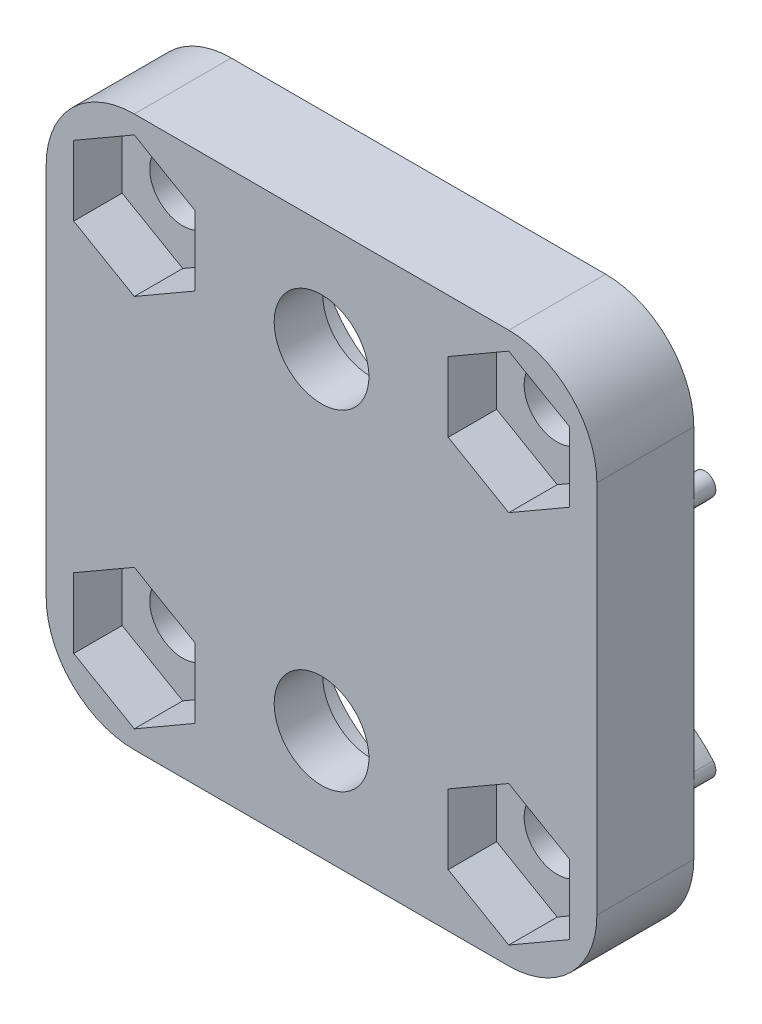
ISO-10303-21;
HEADER;
FILE_DESCRIPTION(('STEP AP214'),'2;1');
FILE_NAME('part.step','',(''),(''),'','','');
FILE_SCHEMA(('AUTOMOTIVE_DESIGN { 1 0 10303 214 1 1 1 1 }'));
ENDSEC;
DATA;
#1=APPLICATION_CONTEXT('core data for automotive mechanical design processes');
#2=APPLICATION_PROTOCOL_DEFINITION('international standard','automotive_design',2000,#1);
#3=PRODUCT_CONTEXT('',#1,'mechanical');
#4=PRODUCT('Part','Part','',(#3));
#5=PRODUCT_RELATED_PRODUCT_CATEGORY('part','',(#4));
#6=PRODUCT_DEFINITION_FORMATION('','',#4);
#7=PRODUCT_DEFINITION_CONTEXT('part definition',#1,'design');
#8=PRODUCT_DEFINITION('design','',#6,#7);
#9=PRODUCT_DEFINITION_SHAPE('','',#8);
#10=(LENGTH_UNIT() NAMED_UNIT(*) SI_UNIT(.MILLI.,.METRE.));
#11=(NAMED_UNIT(*) PLANE_ANGLE_UNIT() SI_UNIT($,.RADIAN.));
#12=(NAMED_UNIT(*) SI_UNIT($,.STERADIAN.) SOLID_ANGLE_UNIT());
#13=UNCERTAINTY_MEASURE_WITH_UNIT(LENGTH_MEASURE(1.E-05),#10,'distance_accuracy_value','');
#14=(GEOMETRIC_REPRESENTATION_CONTEXT(3) GLOBAL_UNCERTAINTY_ASSIGNED_CONTEXT((#13)) GLOBAL_UNIT_ASSIGNED_CONTEXT((#10,
#11,#12)) REPRESENTATION_CONTEXT('',''));
#15=CARTESIAN_POINT('',(0.,0.,0.));
#16=DIRECTION('',(0.,0.,1.));
#17=DIRECTION('',(1.,0.,0.));
#18=AXIS2_PLACEMENT_3D('',#15,#16,#17);
#19=CARTESIAN_POINT('',(17.,17.,-2.2));
#20=DIRECTION('',(0.,0.,1.));
#21=DIRECTION('',(1.,0.,0.));
#22=AXIS2_PLACEMENT_3D('',#19,#20,#21);
#23=PLANE('',#22);
#24=CARTESIAN_POINT('',(17.,17.,-2.2));
#25=DIRECTION('',(0.,0.,1.));
#26=DIRECTION('',(1.,0.,0.));
#27=AXIS2_PLACEMENT_3D('',#24,#25,#26);
#28=CIRCLE('',#27,1.5);
#29=CARTESIAN_POINT('',(18.5,17.,-2.2));
#30=VERTEX_POINT('',#29);
#31=EDGE_CURVE('E807',#30,#30,#28,.T.);
#32=ORIENTED_EDGE('',*,*,#31,.T.);
#33=EDGE_LOOP('',(#32));
#34=FACE_BOUND('',#33,.T.);
#35=CARTESIAN_POINT('',(0.,0.,-2.2));
#36=DIRECTION('',(0.,0.,1.));
#37=DIRECTION('',(1.,0.,0.));
#38=AXIS2_PLACEMENT_3D('',#35,#36,#37);
#39=CIRCLE('',#38,1.5);
#40=CARTESIAN_POINT('',(1.5,0.,-2.2));
#41=VERTEX_POINT('',#40);
#42=EDGE_CURVE('E602',#41,#41,#39,.T.);
#43=ORIENTED_EDGE('',*,*,#42,.T.);
#44=EDGE_LOOP('',(#43));
#45=FACE_BOUND('',#44,.T.);
#46=CARTESIAN_POINT('',(0.,17.,-2.2));
#47=DIRECTION('',(0.,0.,1.));
#48=DIRECTION('',(1.,0.,0.));
#49=AXIS2_PLACEMENT_3D('',#46,#47,#48);
#50=CIRCLE('',#49,1.5);
#51=CARTESIAN_POINT('',(1.5,17.,-2.2));
#52=VERTEX_POINT('',#51);
#53=EDGE_CURVE('E594',#52,#52,#50,.T.);
#54=ORIENTED_EDGE('',*,*,#53,.T.);
#55=EDGE_LOOP('',(#54));
#56=FACE_BOUND('',#55,.T.);
#57=CARTESIAN_POINT('',(17.,0.,-2.2));
#58=DIRECTION('',(0.,0.,1.));
#59=DIRECTION('',(1.,0.,0.));
#60=AXIS2_PLACEMENT_3D('',#57,#58,#59);
#61=CIRCLE('',#60,1.5);
#62=CARTESIAN_POINT('',(18.5,0.,-2.2));
#63=VERTEX_POINT('',#62);
#64=EDGE_CURVE('E585',#63,#63,#61,.T.);
#65=ORIENTED_EDGE('',*,*,#64,.T.);
#66=EDGE_LOOP('',(#65));
#67=FACE_BOUND('',#66,.T.);
#68=CARTESIAN_POINT('',(8.49999999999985,1.,-2.2));
#69=DIRECTION('',(0.,0.,-1.));
#70=DIRECTION('',(-1.,0.,0.));
#71=AXIS2_PLACEMENT_3D('',#68,#69,#70);
#72=CIRCLE('',#71,4.5);
#73=CARTESIAN_POINT('',(3.99999999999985,1.,-2.2));
#74=VERTEX_POINT('',#73);
#75=EDGE_CURVE('E578',#74,#74,#72,.T.);
#76=ORIENTED_EDGE('',*,*,#75,.F.);
#77=EDGE_LOOP('',(#76));
#78=FACE_BOUND('',#77,.T.);
#79=CARTESIAN_POINT('',(8.5,16.,-2.2));
#80=DIRECTION('',(0.,0.,-1.));
#81=DIRECTION('',(-1.,0.,0.));
#82=AXIS2_PLACEMENT_3D('',#79,#80,#81);
#83=CIRCLE('',#82,4.5);
#84=CARTESIAN_POINT('',(4.,16.,-2.2));
#85=VERTEX_POINT('',#84);
#86=EDGE_CURVE('E574',#85,#85,#83,.T.);
#87=ORIENTED_EDGE('',*,*,#86,.F.);
#88=EDGE_LOOP('',(#87));
#89=FACE_BOUND('',#88,.T.);
#90=CARTESIAN_POINT('',(0.,17.,-2.2));
#91=DIRECTION('',(0.,0.,-1.));
#92=DIRECTION('',(1.,0.,0.));
#93=AXIS2_PLACEMENT_3D('',#90,#91,#92);
#94=CIRCLE('',#93,4.1);
#95=CARTESIAN_POINT('',(3.11956521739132,14.3394901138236,-2.2));
#96=VERTEX_POINT('',#95);
#97=CARTESIAN_POINT('',(-3.11956521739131,14.3394901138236,-2.2));
#98=VERTEX_POINT('',#97);
#99=EDGE_CURVE('E403',#96,#98,#94,.T.);
#100=ORIENTED_EDGE('',*,*,#99,.T.);
#101=CARTESIAN_POINT('',(-3.5,14.0150376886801,-2.2));
#102=DIRECTION('',(0.,0.,1.));
#103=DIRECTION('',(1.,0.,0.));
#104=AXIS2_PLACEMENT_3D('',#101,#102,#103);
#105=CIRCLE('',#104,0.5);
#106=CARTESIAN_POINT('',(-4.,14.0150376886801,-2.2));
#107=VERTEX_POINT('',#106);
#108=EDGE_CURVE('E371',#98,#107,#105,.T.);
#109=ORIENTED_EDGE('',*,*,#108,.T.);
#110=DIRECTION('',(0.,-1.,0.));
#111=VECTOR('',#110,1.);
#112=CARTESIAN_POINT('',(-4.,17.,-2.2));
#113=LINE('',#112,#111);
#114=CARTESIAN_POINT('',(-4.,17.,-2.2));
#115=VERTEX_POINT('',#114);
#116=EDGE_CURVE('E918',#115,#107,#113,.T.);
#117=ORIENTED_EDGE('',*,*,#116,.F.);
#118=CARTESIAN_POINT('',(0.,17.,-2.2));
#119=DIRECTION('',(0.,0.,1.));
#120=DIRECTION('',(1.,0.,0.));
#121=AXIS2_PLACEMENT_3D('',#118,#119,#120);
#122=CIRCLE('',#121,4.);
#123=CARTESIAN_POINT('',(0.,21.,-2.2));
#124=VERTEX_POINT('',#123);
#125=EDGE_CURVE('E914',#124,#115,#122,.T.);
#126=ORIENTED_EDGE('',*,*,#125,.F.);
#127=DIRECTION('',(-1.,0.,0.));
#128=VECTOR('',#127,1.);
#129=CARTESIAN_POINT('',(17.,21.,-2.2));
#130=LINE('',#129,#128);
#131=CARTESIAN_POINT('',(17.,21.,-2.2));
#132=VERTEX_POINT('',#131);
#133=EDGE_CURVE('E911',#132,#124,#130,.T.);
#134=ORIENTED_EDGE('',*,*,#133,.F.);
#135=CARTESIAN_POINT('',(17.,17.,-2.2));
#136=DIRECTION('',(0.,0.,1.));
#137=DIRECTION('',(1.,0.,0.));
#138=AXIS2_PLACEMENT_3D('',#135,#136,#137);
#139=CIRCLE('',#138,4.);
#140=CARTESIAN_POINT('',(21.,17.,-2.2));
#141=VERTEX_POINT('',#140);
#142=EDGE_CURVE('E865',#141,#132,#139,.T.);
#143=ORIENTED_EDGE('',*,*,#142,.F.);
#144=DIRECTION('',(0.,1.,0.));
#145=VECTOR('',#144,1.);
#146=CARTESIAN_POINT('',(21.,17.,-2.2));
#147=LINE('',#146,#145);
#148=CARTESIAN_POINT('',(21.,14.0150376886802,-2.2));
#149=VERTEX_POINT('',#148);
#150=EDGE_CURVE('E932',#149,#141,#147,.T.);
#151=ORIENTED_EDGE('',*,*,#150,.F.);
#152=CARTESIAN_POINT('',(20.5,14.0150376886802,-2.2));
#153=DIRECTION('',(0.,0.,-1.));
#154=DIRECTION('',(-1.,0.,0.));
#155=AXIS2_PLACEMENT_3D('',#152,#153,#154);
#156=CIRCLE('',#155,0.5);
#157=CARTESIAN_POINT('',(20.1195652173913,14.3394901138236,-2.2));
#158=VERTEX_POINT('',#157);
#159=EDGE_CURVE('E506',#158,#149,#156,.T.);
#160=ORIENTED_EDGE('',*,*,#159,.F.);
#161=CARTESIAN_POINT('',(17.,17.,-2.2));
#162=DIRECTION('',(0.,0.,1.));
#163=DIRECTION('',(-1.,0.,0.));
#164=AXIS2_PLACEMENT_3D('',#161,#162,#163);
#165=CIRCLE('',#164,4.1);
#166=CARTESIAN_POINT('',(13.8804347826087,14.3394901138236,-2.2));
#167=VERTEX_POINT('',#166);
#168=EDGE_CURVE('E512',#167,#158,#165,.T.);
#169=ORIENTED_EDGE('',*,*,#168,.F.);
#170=CARTESIAN_POINT('',(13.5,14.0150376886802,-2.2));
#171=DIRECTION('',(0.,0.,-1.));
#172=DIRECTION('',(-1.,0.,0.));
#173=AXIS2_PLACEMENT_3D('',#170,#171,#172);
#174=CIRCLE('',#173,0.499999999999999);
#175=CARTESIAN_POINT('',(13.1195652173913,13.6905852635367,-2.2));
#176=VERTEX_POINT('',#175);
#177=EDGE_CURVE('E530',#176,#167,#174,.T.);
#178=ORIENTED_EDGE('',*,*,#177,.F.);
#179=CARTESIAN_POINT('',(17.,17.,-2.2));
#180=DIRECTION('',(0.,0.,-1.));
#181=DIRECTION('',(-1.,0.,0.));
#182=AXIS2_PLACEMENT_3D('',#179,#180,#181);
#183=CIRCLE('',#182,5.1);
#184=CARTESIAN_POINT('',(20.8804347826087,13.6905852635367,-2.2));
#185=VERTEX_POINT('',#184);
#186=EDGE_CURVE('E525',#185,#176,#183,.T.);
#187=ORIENTED_EDGE('',*,*,#186,.F.);
#188=EDGE_CURVE('E526',#149,#185,#156,.T.);
#189=ORIENTED_EDGE('',*,*,#188,.F.);
#190=CARTESIAN_POINT('',(21.,2.98496231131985,-2.2));
#191=VERTEX_POINT('',#190);
#192=EDGE_CURVE('E936',#191,#149,#147,.T.);
#193=ORIENTED_EDGE('',*,*,#192,.F.);
#194=CARTESIAN_POINT('',(20.5,2.98496231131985,-2.2));
#195=DIRECTION('',(0.,0.,1.));
#196=DIRECTION('',(1.,0.,0.));
#197=AXIS2_PLACEMENT_3D('',#194,#195,#196);
#198=CIRCLE('',#197,0.5);
#199=CARTESIAN_POINT('',(20.8804347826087,3.30941473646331,-2.2));
#200=VERTEX_POINT('',#199);
#201=EDGE_CURVE('E56',#191,#200,#198,.T.);
#202=ORIENTED_EDGE('',*,*,#201,.T.);
#203=CARTESIAN_POINT('',(17.,0.,-2.2));
#204=DIRECTION('',(0.,0.,1.));
#205=DIRECTION('',(-1.,0.,0.));
#206=AXIS2_PLACEMENT_3D('',#203,#204,#205);
#207=CIRCLE('',#206,5.1);
#208=CARTESIAN_POINT('',(13.1195652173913,3.30941473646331,-2.2));
#209=VERTEX_POINT('',#208);
#210=EDGE_CURVE('E467',#200,#209,#207,.T.);
#211=ORIENTED_EDGE('',*,*,#210,.T.);
#212=CARTESIAN_POINT('',(13.5,2.98496231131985,-2.2));
#213=DIRECTION('',(0.,0.,1.));
#214=DIRECTION('',(-1.,0.,0.));
#215=AXIS2_PLACEMENT_3D('',#212,#213,#214);
#216=CIRCLE('',#215,0.499999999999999);
#217=CARTESIAN_POINT('',(13.8804347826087,2.66050988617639,-2.2));
#218=VERTEX_POINT('',#217);
#219=EDGE_CURVE('E487',#209,#218,#216,.T.);
#220=ORIENTED_EDGE('',*,*,#219,.T.);
#221=CARTESIAN_POINT('',(17.,0.,-2.2));
#222=DIRECTION('',(0.,0.,-1.));
#223=DIRECTION('',(-1.,0.,0.));
#224=AXIS2_PLACEMENT_3D('',#221,#222,#223);
#225=CIRCLE('',#224,4.1);
#226=CARTESIAN_POINT('',(20.1195652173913,2.66050988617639,-2.2));
#227=VERTEX_POINT('',#226);
#228=EDGE_CURVE('E483',#218,#227,#225,.T.);
#229=ORIENTED_EDGE('',*,*,#228,.T.);
#230=CARTESIAN_POINT('',(20.5,2.98496231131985,-2.2));
#231=DIRECTION('',(0.,0.,1.));
#232=DIRECTION('',(-1.,0.,0.));
#233=AXIS2_PLACEMENT_3D('',#230,#231,#232);
#234=CIRCLE('',#233,0.5);
#235=EDGE_CURVE('E461',#227,#191,#234,.T.);
#236=ORIENTED_EDGE('',*,*,#235,.T.);
#237=CARTESIAN_POINT('',(21.,0.,-2.2));
#238=VERTEX_POINT('',#237);
#239=EDGE_CURVE('E886',#238,#191,#147,.T.);
#240=ORIENTED_EDGE('',*,*,#239,.F.);
#241=CARTESIAN_POINT('',(17.,0.,-2.2));
#242=DIRECTION('',(0.,0.,1.));
#243=DIRECTION('',(1.,0.,0.));
#244=AXIS2_PLACEMENT_3D('',#241,#242,#243);
#245=CIRCLE('',#244,4.);
#246=CARTESIAN_POINT('',(17.,-4.,-2.2));
#247=VERTEX_POINT('',#246);
#248=EDGE_CURVE('E929',#247,#238,#245,.T.);
#249=ORIENTED_EDGE('',*,*,#248,.F.);
#250=DIRECTION('',(1.,0.,0.));
#251=VECTOR('',#250,1.);
#252=CARTESIAN_POINT('',(17.,-4.,-2.2));
#253=LINE('',#252,#251);
#254=CARTESIAN_POINT('',(0.,-4.,-2.2));
#255=VERTEX_POINT('',#254);
#256=EDGE_CURVE('E926',#255,#247,#253,.T.);
#257=ORIENTED_EDGE('',*,*,#256,.F.);
#258=CARTESIAN_POINT('',(0.,0.,-2.2));
#259=DIRECTION('',(0.,0.,1.));
#260=DIRECTION('',(1.,0.,0.));
#261=AXIS2_PLACEMENT_3D('',#258,#259,#260);
#262=CIRCLE('',#261,4.);
#263=CARTESIAN_POINT('',(-4.,0.,-2.2));
#264=VERTEX_POINT('',#263);
#265=EDGE_CURVE('E922',#264,#255,#262,.T.);
#266=ORIENTED_EDGE('',*,*,#265,.F.);
#267=CARTESIAN_POINT('',(-4.,2.98496231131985,-2.2));
#268=VERTEX_POINT('',#267);
#269=EDGE_CURVE('E917',#268,#264,#113,.T.);
#270=ORIENTED_EDGE('',*,*,#269,.F.);
#271=CARTESIAN_POINT('',(-3.5,2.98496231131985,-2.2));
#272=DIRECTION('',(0.,0.,-1.));
#273=DIRECTION('',(1.,0.,0.));
#274=AXIS2_PLACEMENT_3D('',#271,#272,#273);
#275=CIRCLE('',#274,0.5);
#276=CARTESIAN_POINT('',(-3.11956521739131,2.66050988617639,-2.2));
#277=VERTEX_POINT('',#276);
#278=EDGE_CURVE('E377',#277,#268,#275,.T.);
#279=ORIENTED_EDGE('',*,*,#278,.F.);
#280=CARTESIAN_POINT('',(0.,0.,-2.2));
#281=DIRECTION('',(0.,0.,1.));
#282=DIRECTION('',(1.,0.,0.));
#283=AXIS2_PLACEMENT_3D('',#280,#281,#282);
#284=CIRCLE('',#283,4.1);
#285=CARTESIAN_POINT('',(3.11956521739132,2.66050988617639,-2.2));
#286=VERTEX_POINT('',#285);
#287=EDGE_CURVE('E424',#286,#277,#284,.T.);
#288=ORIENTED_EDGE('',*,*,#287,.F.);
#289=CARTESIAN_POINT('',(3.50000000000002,2.98496231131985,-2.2));
#290=DIRECTION('',(0.,0.,-1.));
#291=DIRECTION('',(1.,0.,0.));
#292=AXIS2_PLACEMENT_3D('',#289,#290,#291);
#293=CIRCLE('',#292,0.499999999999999);
#294=CARTESIAN_POINT('',(3.88043478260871,3.30941473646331,-2.2));
#295=VERTEX_POINT('',#294);
#296=EDGE_CURVE('E439',#295,#286,#293,.T.);
#297=ORIENTED_EDGE('',*,*,#296,.F.);
#298=CARTESIAN_POINT('',(0.,0.,-2.2));
#299=DIRECTION('',(0.,0.,-1.));
#300=DIRECTION('',(1.,0.,0.));
#301=AXIS2_PLACEMENT_3D('',#298,#299,#300);
#302=CIRCLE('',#301,5.1);
#303=CARTESIAN_POINT('',(-3.8804347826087,3.30941473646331,-2.2));
#304=VERTEX_POINT('',#303);
#305=EDGE_CURVE('E71',#304,#295,#302,.T.);
#306=ORIENTED_EDGE('',*,*,#305,.F.);
#307=CARTESIAN_POINT('',(-3.5,2.98496231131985,-2.2));
#308=DIRECTION('',(0.,0.,1.));
#309=DIRECTION('',(1.,0.,0.));
#310=AXIS2_PLACEMENT_3D('',#307,#308,#309);
#311=CIRCLE('',#310,0.5);
#312=EDGE_CURVE('E11',#268,#304,#311,.F.);
#313=ORIENTED_EDGE('',*,*,#312,.F.);
#314=EDGE_CURVE('E923',#107,#268,#113,.T.);
#315=ORIENTED_EDGE('',*,*,#314,.F.);
#316=CARTESIAN_POINT('',(-3.8804347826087,13.6905852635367,-2.2));
#317=VERTEX_POINT('',#316);
#318=EDGE_CURVE('E404',#107,#317,#105,.T.);
#319=ORIENTED_EDGE('',*,*,#318,.T.);
#320=CARTESIAN_POINT('',(0.,17.,-2.2));
#321=DIRECTION('',(0.,0.,1.));
#322=DIRECTION('',(1.,0.,0.));
#323=AXIS2_PLACEMENT_3D('',#320,#321,#322);
#324=CIRCLE('',#323,5.1);
#325=CARTESIAN_POINT('',(3.88043478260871,13.6905852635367,-2.2));
#326=VERTEX_POINT('',#325);
#327=EDGE_CURVE('E389',#317,#326,#324,.T.);
#328=ORIENTED_EDGE('',*,*,#327,.T.);
#329=CARTESIAN_POINT('',(3.50000000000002,14.0150376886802,-2.2));
#330=DIRECTION('',(0.,0.,1.));
#331=DIRECTION('',(1.,0.,0.));
#332=AXIS2_PLACEMENT_3D('',#329,#330,#331);
#333=CIRCLE('',#332,0.499999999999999);
#334=EDGE_CURVE('E63',#326,#96,#333,.T.);
#335=ORIENTED_EDGE('',*,*,#334,.T.);
#336=EDGE_LOOP('',(#100,#109,#117,#126,#134,#143,#151,#160,#169,#178,#187,#189,#193,#202,#211,
#220,#229,#236,#240,#249,#257,#266,#270,#279,#288,#297,#306,#313,#315,#319,#328,#335));
#337=FACE_BOUND('',#336,.T.);
#338=ADVANCED_FACE('F47',(#34,#45,#56,#67,#78,#89,#337),#23,.F.);
#339=CARTESIAN_POINT('',(17.,17.,2.2));
#340=DIRECTION('',(0.,0.,-1.));
#341=DIRECTION('',(-1.,0.,0.));
#342=AXIS2_PLACEMENT_3D('',#339,#340,#341);
#343=CYLINDRICAL_SURFACE('',#342,4.);
#344=ORIENTED_EDGE('',*,*,#142,.T.);
#345=DIRECTION('',(0.,0.,-1.));
#346=VECTOR('',#345,1.);
#347=CARTESIAN_POINT('',(17.,21.,2.2));
#348=LINE('',#347,#346);
#349=CARTESIAN_POINT('',(17.,21.,2.2));
#350=VERTEX_POINT('',#349);
#351=EDGE_CURVE('E964',#350,#132,#348,.T.);
#352=ORIENTED_EDGE('',*,*,#351,.F.);
#353=CARTESIAN_POINT('',(17.,17.,2.2));
#354=DIRECTION('',(0.,0.,1.));
#355=DIRECTION('',(1.,0.,0.));
#356=AXIS2_PLACEMENT_3D('',#353,#354,#355);
#357=CIRCLE('',#356,4.);
#358=CARTESIAN_POINT('',(21.,17.,2.2));
#359=VERTEX_POINT('',#358);
#360=EDGE_CURVE('E881',#359,#350,#357,.T.);
#361=ORIENTED_EDGE('',*,*,#360,.F.);
#362=DIRECTION('',(0.,0.,-1.));
#363=VECTOR('',#362,1.);
#364=CARTESIAN_POINT('',(21.,17.,2.2));
#365=LINE('',#364,#363);
#366=EDGE_CURVE('E907',#359,#141,#365,.T.);
#367=ORIENTED_EDGE('',*,*,#366,.T.);
#368=EDGE_LOOP('',(#344,#352,#361,#367));
#369=FACE_BOUND('',#368,.T.);
#370=ADVANCED_FACE('F49',(#369),#343,.T.);
#371=CARTESIAN_POINT('',(17.,21.,2.2));
#372=DIRECTION('',(0.,-1.,0.));
#373=DIRECTION('',(1.,0.,0.));
#374=AXIS2_PLACEMENT_3D('',#371,#372,#373);
#375=PLANE('',#374);
#376=ORIENTED_EDGE('',*,*,#133,.T.);
#377=DIRECTION('',(0.,0.,-1.));
#378=VECTOR('',#377,1.);
#379=CARTESIAN_POINT('',(0.,21.,2.2));
#380=LINE('',#379,#378);
#381=CARTESIAN_POINT('',(0.,21.,2.2));
#382=VERTEX_POINT('',#381);
#383=EDGE_CURVE('E960',#382,#124,#380,.T.);
#384=ORIENTED_EDGE('',*,*,#383,.F.);
#385=DIRECTION('',(-1.,0.,0.));
#386=VECTOR('',#385,1.);
#387=CARTESIAN_POINT('',(17.,21.,2.2));
#388=LINE('',#387,#386);
#389=EDGE_CURVE('E885',#350,#382,#388,.T.);
#390=ORIENTED_EDGE('',*,*,#389,.F.);
#391=ORIENTED_EDGE('',*,*,#351,.T.);
#392=EDGE_LOOP('',(#376,#384,#390,#391));
#393=FACE_BOUND('',#392,.T.);
#394=ADVANCED_FACE('F1007',(#393),#375,.F.);
#395=CARTESIAN_POINT('',(0.,17.,2.2));
#396=DIRECTION('',(0.,0.,-1.));
#397=DIRECTION('',(-1.,0.,0.));
#398=AXIS2_PLACEMENT_3D('',#395,#396,#397);
#399=CYLINDRICAL_SURFACE('',#398,4.);
#400=ORIENTED_EDGE('',*,*,#125,.T.);
#401=DIRECTION('',(0.,0.,-1.));
#402=VECTOR('',#401,1.);
#403=CARTESIAN_POINT('',(-4.,17.,2.2));
#404=LINE('',#403,#402);
#405=CARTESIAN_POINT('',(-4.,17.,2.2));
#406=VERTEX_POINT('',#405);
#407=EDGE_CURVE('E956',#406,#115,#404,.T.);
#408=ORIENTED_EDGE('',*,*,#407,.F.);
#409=CARTESIAN_POINT('',(0.,17.,2.2));
#410=DIRECTION('',(0.,0.,1.));
#411=DIRECTION('',(1.,0.,0.));
#412=AXIS2_PLACEMENT_3D('',#409,#410,#411);
#413=CIRCLE('',#412,4.);
#414=EDGE_CURVE('E889',#382,#406,#413,.T.);
#415=ORIENTED_EDGE('',*,*,#414,.F.);
#416=ORIENTED_EDGE('',*,*,#383,.T.);
#417=EDGE_LOOP('',(#400,#408,#415,#416));
#418=FACE_BOUND('',#417,.T.);
#419=ADVANCED_FACE('F1032',(#418),#399,.T.);
#420=CARTESIAN_POINT('',(-4.,17.,2.2));
#421=DIRECTION('',(1.,0.,0.));
#422=DIRECTION('',(0.,1.,0.));
#423=AXIS2_PLACEMENT_3D('',#420,#421,#422);
#424=PLANE('',#423);
#425=ORIENTED_EDGE('',*,*,#116,.T.);
#426=ORIENTED_EDGE('',*,*,#314,.T.);
#427=ORIENTED_EDGE('',*,*,#269,.T.);
#428=DIRECTION('',(0.,0.,-1.));
#429=VECTOR('',#428,1.);
#430=CARTESIAN_POINT('',(-4.,0.,2.2));
#431=LINE('',#430,#429);
#432=CARTESIAN_POINT('',(-4.,0.,2.2));
#433=VERTEX_POINT('',#432);
#434=EDGE_CURVE('E952',#433,#264,#431,.T.);
#435=ORIENTED_EDGE('',*,*,#434,.F.);
#436=DIRECTION('',(0.,-1.,0.));
#437=VECTOR('',#436,1.);
#438=CARTESIAN_POINT('',(-4.,17.,2.2));
#439=LINE('',#438,#437);
#440=EDGE_CURVE('E892',#406,#433,#439,.T.);
#441=ORIENTED_EDGE('',*,*,#440,.F.);
#442=ORIENTED_EDGE('',*,*,#407,.T.);
#443=EDGE_LOOP('',(#425,#426,#427,#435,#441,#442));
#444=FACE_BOUND('',#443,.T.);
#445=ADVANCED_FACE('F1029',(#444),#424,.F.);
#446=CARTESIAN_POINT('',(0.,0.,2.2));
#447=DIRECTION('',(0.,0.,-1.));
#448=DIRECTION('',(-1.,0.,0.));
#449=AXIS2_PLACEMENT_3D('',#446,#447,#448);
#450=CYLINDRICAL_SURFACE('',#449,4.);
#451=ORIENTED_EDGE('',*,*,#265,.T.);
#452=DIRECTION('',(0.,0.,-1.));
#453=VECTOR('',#452,1.);
#454=CARTESIAN_POINT('',(0.,-4.,2.2));
#455=LINE('',#454,#453);
#456=CARTESIAN_POINT('',(0.,-4.,2.2));
#457=VERTEX_POINT('',#456);
#458=EDGE_CURVE('E948',#457,#255,#455,.T.);
#459=ORIENTED_EDGE('',*,*,#458,.F.);
#460=CARTESIAN_POINT('',(0.,0.,2.2));
#461=DIRECTION('',(0.,0.,1.));
#462=DIRECTION('',(1.,0.,0.));
#463=AXIS2_PLACEMENT_3D('',#460,#461,#462);
#464=CIRCLE('',#463,4.);
#465=EDGE_CURVE('E895',#433,#457,#464,.T.);
#466=ORIENTED_EDGE('',*,*,#465,.F.);
#467=ORIENTED_EDGE('',*,*,#434,.T.);
#468=EDGE_LOOP('',(#451,#459,#466,#467));
#469=FACE_BOUND('',#468,.T.);
#470=ADVANCED_FACE('F1025',(#469),#450,.T.);
#471=CARTESIAN_POINT('',(17.,-4.,2.2));
#472=DIRECTION('',(0.,1.,0.));
#473=DIRECTION('',(-1.,0.,0.));
#474=AXIS2_PLACEMENT_3D('',#471,#472,#473);
#475=PLANE('',#474);
#476=ORIENTED_EDGE('',*,*,#256,.T.);
#477=DIRECTION('',(0.,0.,-1.));
#478=VECTOR('',#477,1.);
#479=CARTESIAN_POINT('',(17.,-4.,2.2));
#480=LINE('',#479,#478);
#481=CARTESIAN_POINT('',(17.,-4.,2.2));
#482=VERTEX_POINT('',#481);
#483=EDGE_CURVE('E944',#482,#247,#480,.T.);
#484=ORIENTED_EDGE('',*,*,#483,.F.);
#485=DIRECTION('',(1.,0.,0.));
#486=VECTOR('',#485,1.);
#487=CARTESIAN_POINT('',(17.,-4.,2.2));
#488=LINE('',#487,#486);
#489=EDGE_CURVE('E898',#457,#482,#488,.T.);
#490=ORIENTED_EDGE('',*,*,#489,.F.);
#491=ORIENTED_EDGE('',*,*,#458,.T.);
#492=EDGE_LOOP('',(#476,#484,#490,#491));
#493=FACE_BOUND('',#492,.T.);
#494=ADVANCED_FACE('F1021',(#493),#475,.F.);
#495=CARTESIAN_POINT('',(17.,0.,2.2));
#496=DIRECTION('',(0.,0.,-1.));
#497=DIRECTION('',(-1.,0.,0.));
#498=AXIS2_PLACEMENT_3D('',#495,#496,#497);
#499=CYLINDRICAL_SURFACE('',#498,4.);
#500=ORIENTED_EDGE('',*,*,#248,.T.);
#501=DIRECTION('',(0.,0.,-1.));
#502=VECTOR('',#501,1.);
#503=CARTESIAN_POINT('',(21.,0.,2.2));
#504=LINE('',#503,#502);
#505=CARTESIAN_POINT('',(21.,0.,2.2));
#506=VERTEX_POINT('',#505);
#507=EDGE_CURVE('E940',#506,#238,#504,.T.);
#508=ORIENTED_EDGE('',*,*,#507,.F.);
#509=CARTESIAN_POINT('',(17.,0.,2.2));
#510=DIRECTION('',(0.,0.,1.));
#511=DIRECTION('',(1.,0.,0.));
#512=AXIS2_PLACEMENT_3D('',#509,#510,#511);
#513=CIRCLE('',#512,4.);
#514=EDGE_CURVE('E901',#482,#506,#513,.T.);
#515=ORIENTED_EDGE('',*,*,#514,.F.);
#516=ORIENTED_EDGE('',*,*,#483,.T.);
#517=EDGE_LOOP('',(#500,#508,#515,#516));
#518=FACE_BOUND('',#517,.T.);
#519=ADVANCED_FACE('F1017',(#518),#499,.T.);
#520=CARTESIAN_POINT('',(21.,17.,2.2));
#521=DIRECTION('',(-1.,0.,0.));
#522=DIRECTION('',(0.,-1.,0.));
#523=AXIS2_PLACEMENT_3D('',#520,#521,#522);
#524=PLANE('',#523);
#525=ORIENTED_EDGE('',*,*,#239,.T.);
#526=ORIENTED_EDGE('',*,*,#192,.T.);
#527=ORIENTED_EDGE('',*,*,#150,.T.);
#528=ORIENTED_EDGE('',*,*,#366,.F.);
#529=DIRECTION('',(0.,1.,0.));
#530=VECTOR('',#529,1.);
#531=CARTESIAN_POINT('',(21.,17.,2.2));
#532=LINE('',#531,#530);
#533=EDGE_CURVE('E904',#506,#359,#532,.T.);
#534=ORIENTED_EDGE('',*,*,#533,.F.);
#535=ORIENTED_EDGE('',*,*,#507,.T.);
#536=EDGE_LOOP('',(#525,#526,#527,#528,#534,#535));
#537=FACE_BOUND('',#536,.T.);
#538=ADVANCED_FACE('F1014',(#537),#524,.F.);
#539=CARTESIAN_POINT('',(17.,17.,2.2));
#540=DIRECTION('',(0.,0.,1.));
#541=DIRECTION('',(1.,0.,0.));
#542=AXIS2_PLACEMENT_3D('',#539,#540,#541);
#543=PLANE('',#542);
#544=CARTESIAN_POINT('',(8.5,16.,2.2));
#545=DIRECTION('',(0.,0.,-1.));
#546=DIRECTION('',(-1.,0.,0.));
#547=AXIS2_PLACEMENT_3D('',#544,#545,#546);
#548=CIRCLE('',#547,2.15);
#549=CARTESIAN_POINT('',(6.35,16.,2.2));
#550=VERTEX_POINT('',#549);
#551=EDGE_CURVE('E553',#550,#550,#548,.T.);
#552=ORIENTED_EDGE('',*,*,#551,.T.);
#553=EDGE_LOOP('',(#552));
#554=FACE_BOUND('',#553,.T.);
#555=CARTESIAN_POINT('',(8.49999999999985,1.,2.2));
#556=DIRECTION('',(0.,0.,-1.));
#557=DIRECTION('',(-1.,0.,0.));
#558=AXIS2_PLACEMENT_3D('',#555,#556,#557);
#559=CIRCLE('',#558,2.15);
#560=CARTESIAN_POINT('',(6.34999999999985,1.,2.2));
#561=VERTEX_POINT('',#560);
#562=EDGE_CURVE('E552',#561,#561,#559,.T.);
#563=ORIENTED_EDGE('',*,*,#562,.T.);
#564=EDGE_LOOP('',(#563));
#565=FACE_BOUND('',#564,.T.);
#566=DIRECTION('',(0.866025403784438,0.500000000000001,0.));
#567=VECTOR('',#566,1.);
#568=CARTESIAN_POINT('',(17.,-3.17542648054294,2.2));
#569=LINE('',#568,#567);
#570=CARTESIAN_POINT('',(17.,-3.17542648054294,2.2));
#571=VERTEX_POINT('',#570);
#572=CARTESIAN_POINT('',(19.75,-1.58771324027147,2.2));
#573=VERTEX_POINT('',#572);
#574=EDGE_CURVE('E635',#571,#573,#569,.T.);
#575=ORIENTED_EDGE('',*,*,#574,.F.);
#576=DIRECTION('',(0.866025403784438,-0.5,0.));
#577=VECTOR('',#576,1.);
#578=CARTESIAN_POINT('',(14.25,-1.58771324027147,2.2));
#579=LINE('',#578,#577);
#580=CARTESIAN_POINT('',(14.25,-1.58771324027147,2.2));
#581=VERTEX_POINT('',#580);
#582=EDGE_CURVE('E614',#581,#571,#579,.T.);
#583=ORIENTED_EDGE('',*,*,#582,.F.);
#584=DIRECTION('',(0.,-1.,0.));
#585=VECTOR('',#584,1.);
#586=CARTESIAN_POINT('',(14.25,1.58771324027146,2.2));
#587=LINE('',#586,#585);
#588=CARTESIAN_POINT('',(14.25,1.58771324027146,2.2));
#589=VERTEX_POINT('',#588);
#590=EDGE_CURVE('E651',#589,#581,#587,.T.);
#591=ORIENTED_EDGE('',*,*,#590,.F.);
#592=DIRECTION('',(-0.866025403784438,-0.5,0.));
#593=VECTOR('',#592,1.);
#594=CARTESIAN_POINT('',(17.,3.17542648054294,2.2));
#595=LINE('',#594,#593);
#596=CARTESIAN_POINT('',(17.,3.17542648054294,2.2));
#597=VERTEX_POINT('',#596);
#598=EDGE_CURVE('E647',#597,#589,#595,.T.);
#599=ORIENTED_EDGE('',*,*,#598,.F.);
#600=DIRECTION('',(-0.866025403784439,0.5,0.));
#601=VECTOR('',#600,1.);
#602=CARTESIAN_POINT('',(19.75,1.58771324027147,2.2));
#603=LINE('',#602,#601);
#604=CARTESIAN_POINT('',(19.75,1.58771324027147,2.2));
#605=VERTEX_POINT('',#604);
#606=EDGE_CURVE('E643',#605,#597,#603,.T.);
#607=ORIENTED_EDGE('',*,*,#606,.F.);
#608=DIRECTION('',(0.,1.,0.));
#609=VECTOR('',#608,1.);
#610=CARTESIAN_POINT('',(19.75,-1.58771324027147,2.2));
#611=LINE('',#610,#609);
#612=EDGE_CURVE('E638',#573,#605,#611,.T.);
#613=ORIENTED_EDGE('',*,*,#612,.F.);
#614=EDGE_LOOP('',(#575,#583,#591,#599,#607,#613));
#615=FACE_BOUND('',#614,.T.);
#616=DIRECTION('',(0.866025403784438,0.500000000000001,0.));
#617=VECTOR('',#616,1.);
#618=CARTESIAN_POINT('',(0.,13.8245735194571,2.2));
#619=LINE('',#618,#617);
#620=CARTESIAN_POINT('',(0.,13.8245735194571,2.2));
#621=VERTEX_POINT('',#620);
#622=CARTESIAN_POINT('',(2.75,15.4122867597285,2.2));
#623=VERTEX_POINT('',#622);
#624=EDGE_CURVE('E703',#621,#623,#619,.T.);
#625=ORIENTED_EDGE('',*,*,#624,.F.);
#626=DIRECTION('',(0.866025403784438,-0.5,0.));
#627=VECTOR('',#626,1.);
#628=CARTESIAN_POINT('',(-2.75,15.4122867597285,2.2));
#629=LINE('',#628,#627);
#630=CARTESIAN_POINT('',(-2.75,15.4122867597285,2.2));
#631=VERTEX_POINT('',#630);
#632=EDGE_CURVE('E682',#631,#621,#629,.T.);
#633=ORIENTED_EDGE('',*,*,#632,.F.);
#634=DIRECTION('',(0.,-1.,0.));
#635=VECTOR('',#634,1.);
#636=CARTESIAN_POINT('',(-2.75,18.5877132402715,2.2));
#637=LINE('',#636,#635);
#638=CARTESIAN_POINT('',(-2.75,18.5877132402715,2.2));
#639=VERTEX_POINT('',#638);
#640=EDGE_CURVE('E719',#639,#631,#637,.T.);
#641=ORIENTED_EDGE('',*,*,#640,.F.);
#642=DIRECTION('',(-0.866025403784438,-0.5,0.));
#643=VECTOR('',#642,1.);
#644=CARTESIAN_POINT('',(0.,20.1754264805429,2.2));
#645=LINE('',#644,#643);
#646=CARTESIAN_POINT('',(0.,20.1754264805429,2.2));
#647=VERTEX_POINT('',#646);
#648=EDGE_CURVE('E715',#647,#639,#645,.T.);
#649=ORIENTED_EDGE('',*,*,#648,.F.);
#650=DIRECTION('',(-0.866025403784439,0.5,0.));
#651=VECTOR('',#650,1.);
#652=CARTESIAN_POINT('',(2.75,18.5877132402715,2.2));
#653=LINE('',#652,#651);
#654=CARTESIAN_POINT('',(2.75,18.5877132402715,2.2));
#655=VERTEX_POINT('',#654);
#656=EDGE_CURVE('E711',#655,#647,#653,.T.);
#657=ORIENTED_EDGE('',*,*,#656,.F.);
#658=DIRECTION('',(0.,1.,0.));
#659=VECTOR('',#658,1.);
#660=CARTESIAN_POINT('',(2.75,15.4122867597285,2.2));
#661=LINE('',#660,#659);
#662=EDGE_CURVE('E706',#623,#655,#661,.T.);
#663=ORIENTED_EDGE('',*,*,#662,.F.);
#664=EDGE_LOOP('',(#625,#633,#641,#649,#657,#663));
#665=FACE_BOUND('',#664,.T.);
#666=DIRECTION('',(0.866025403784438,0.500000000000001,0.));
#667=VECTOR('',#666,1.);
#668=CARTESIAN_POINT('',(0.,-3.17542648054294,2.2));
#669=LINE('',#668,#667);
#670=CARTESIAN_POINT('',(0.,-3.17542648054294,2.2));
#671=VERTEX_POINT('',#670);
#672=CARTESIAN_POINT('',(2.75,-1.58771324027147,2.2));
#673=VERTEX_POINT('',#672);
#674=EDGE_CURVE('E589',#671,#673,#669,.T.);
#675=ORIENTED_EDGE('',*,*,#674,.F.);
#676=DIRECTION('',(0.866025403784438,-0.5,0.));
#677=VECTOR('',#676,1.);
#678=CARTESIAN_POINT('',(-2.75,-1.58771324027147,2.2));
#679=LINE('',#678,#677);
#680=CARTESIAN_POINT('',(-2.75,-1.58771324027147,2.2));
#681=VERTEX_POINT('',#680);
#682=EDGE_CURVE('E748',#681,#671,#679,.T.);
#683=ORIENTED_EDGE('',*,*,#682,.F.);
#684=DIRECTION('',(0.,-1.,0.));
#685=VECTOR('',#684,1.);
#686=CARTESIAN_POINT('',(-2.75,1.58771324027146,2.2));
#687=LINE('',#686,#685);
#688=CARTESIAN_POINT('',(-2.75,1.58771324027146,2.2));
#689=VERTEX_POINT('',#688);
#690=EDGE_CURVE('E783',#689,#681,#687,.T.);
#691=ORIENTED_EDGE('',*,*,#690,.F.);
#692=DIRECTION('',(-0.866025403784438,-0.5,0.));
#693=VECTOR('',#692,1.);
#694=CARTESIAN_POINT('',(0.,3.17542648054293,2.2));
#695=LINE('',#694,#693);
#696=CARTESIAN_POINT('',(0.,3.17542648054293,2.2));
#697=VERTEX_POINT('',#696);
#698=EDGE_CURVE('E779',#697,#689,#695,.T.);
#699=ORIENTED_EDGE('',*,*,#698,.F.);
#700=DIRECTION('',(-0.866025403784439,0.5,0.));
#701=VECTOR('',#700,1.);
#702=CARTESIAN_POINT('',(2.75,1.58771324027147,2.2));
#703=LINE('',#702,#701);
#704=CARTESIAN_POINT('',(2.75,1.58771324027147,2.2));
#705=VERTEX_POINT('',#704);
#706=EDGE_CURVE('E775',#705,#697,#703,.T.);
#707=ORIENTED_EDGE('',*,*,#706,.F.);
#708=DIRECTION('',(0.,1.,0.));
#709=VECTOR('',#708,1.);
#710=CARTESIAN_POINT('',(2.75,-1.58771324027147,2.2));
#711=LINE('',#710,#709);
#712=EDGE_CURVE('E771',#673,#705,#711,.T.);
#713=ORIENTED_EDGE('',*,*,#712,.F.);
#714=EDGE_LOOP('',(#675,#683,#691,#699,#707,#713));
#715=FACE_BOUND('',#714,.T.);
#716=DIRECTION('',(0.866025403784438,0.500000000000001,0.));
#717=VECTOR('',#716,1.);
#718=CARTESIAN_POINT('',(17.,13.8245735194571,2.2));
#719=LINE('',#718,#717);
#720=CARTESIAN_POINT('',(17.,13.8245735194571,2.2));
#721=VERTEX_POINT('',#720);
#722=CARTESIAN_POINT('',(19.75,15.4122867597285,2.2));
#723=VERTEX_POINT('',#722);
#724=EDGE_CURVE('E811',#721,#723,#719,.T.);
#725=ORIENTED_EDGE('',*,*,#724,.F.);
#726=DIRECTION('',(0.866025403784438,-0.5,0.));
#727=VECTOR('',#726,1.);
#728=CARTESIAN_POINT('',(14.25,15.4122867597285,2.2));
#729=LINE('',#728,#727);
#730=CARTESIAN_POINT('',(14.25,15.4122867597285,2.2));
#731=VERTEX_POINT('',#730);
#732=EDGE_CURVE('E820',#731,#721,#729,.T.);
#733=ORIENTED_EDGE('',*,*,#732,.F.);
#734=DIRECTION('',(0.,-1.,0.));
#735=VECTOR('',#734,1.);
#736=CARTESIAN_POINT('',(14.25,18.5877132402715,2.2));
#737=LINE('',#736,#735);
#738=CARTESIAN_POINT('',(14.25,18.5877132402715,2.2));
#739=VERTEX_POINT('',#738);
#740=EDGE_CURVE('E855',#739,#731,#737,.T.);
#741=ORIENTED_EDGE('',*,*,#740,.F.);
#742=DIRECTION('',(-0.866025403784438,-0.5,0.));
#743=VECTOR('',#742,1.);
#744=CARTESIAN_POINT('',(17.,20.1754264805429,2.2));
#745=LINE('',#744,#743);
#746=CARTESIAN_POINT('',(17.,20.1754264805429,2.2));
#747=VERTEX_POINT('',#746);
#748=EDGE_CURVE('E851',#747,#739,#745,.T.);
#749=ORIENTED_EDGE('',*,*,#748,.F.);
#750=DIRECTION('',(-0.866025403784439,0.5,0.));
#751=VECTOR('',#750,1.);
#752=CARTESIAN_POINT('',(19.75,18.5877132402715,2.2));
#753=LINE('',#752,#751);
#754=CARTESIAN_POINT('',(19.75,18.5877132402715,2.2));
#755=VERTEX_POINT('',#754);
#756=EDGE_CURVE('E847',#755,#747,#753,.T.);
#757=ORIENTED_EDGE('',*,*,#756,.F.);
#758=DIRECTION('',(0.,1.,0.));
#759=VECTOR('',#758,1.);
#760=CARTESIAN_POINT('',(19.75,15.4122867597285,2.2));
#761=LINE('',#760,#759);
#762=EDGE_CURVE('E843',#723,#755,#761,.T.);
#763=ORIENTED_EDGE('',*,*,#762,.F.);
#764=EDGE_LOOP('',(#725,#733,#741,#749,#757,#763));
#765=FACE_BOUND('',#764,.T.);
#766=ORIENTED_EDGE('',*,*,#360,.T.);
#767=ORIENTED_EDGE('',*,*,#389,.T.);
#768=ORIENTED_EDGE('',*,*,#414,.T.);
#769=ORIENTED_EDGE('',*,*,#440,.T.);
#770=ORIENTED_EDGE('',*,*,#465,.T.);
#771=ORIENTED_EDGE('',*,*,#489,.T.);
#772=ORIENTED_EDGE('',*,*,#514,.T.);
#773=ORIENTED_EDGE('',*,*,#533,.T.);
#774=EDGE_LOOP('',(#766,#767,#768,#769,#770,#771,#772,#773));
#775=FACE_BOUND('',#774,.T.);
#776=ADVANCED_FACE('F1012',(#554,#565,#615,#665,#715,#765,#775),#543,.T.);
#777=CARTESIAN_POINT('',(17.,13.8245735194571,0.));
#778=DIRECTION('',(0.500000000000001,-0.866025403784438,0.));
#779=DIRECTION('',(0.866025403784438,0.500000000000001,0.));
#780=AXIS2_PLACEMENT_3D('',#777,#778,#779);
#781=PLANE('',#780);
#782=ORIENTED_EDGE('',*,*,#724,.T.);
#783=DIRECTION('',(0.,0.,1.));
#784=VECTOR('',#783,1.);
#785=CARTESIAN_POINT('',(19.75,15.4122867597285,0.));
#786=LINE('',#785,#784);
#787=CARTESIAN_POINT('',(19.75,15.4122867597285,0.));
#788=VERTEX_POINT('',#787);
#789=EDGE_CURVE('E840',#788,#723,#786,.T.);
#790=ORIENTED_EDGE('',*,*,#789,.F.);
#791=DIRECTION('',(0.866025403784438,0.500000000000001,0.));
#792=VECTOR('',#791,1.);
#793=CARTESIAN_POINT('',(17.,13.8245735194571,0.));
#794=LINE('',#793,#792);
#795=CARTESIAN_POINT('',(17.,13.8245735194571,0.));
#796=VERTEX_POINT('',#795);
#797=EDGE_CURVE('E815',#796,#788,#794,.T.);
#798=ORIENTED_EDGE('',*,*,#797,.F.);
#799=DIRECTION('',(0.,0.,1.));
#800=VECTOR('',#799,1.);
#801=CARTESIAN_POINT('',(17.,13.8245735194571,0.));
#802=LINE('',#801,#800);
#803=EDGE_CURVE('E862',#796,#721,#802,.T.);
#804=ORIENTED_EDGE('',*,*,#803,.T.);
#805=EDGE_LOOP('',(#782,#790,#798,#804));
#806=FACE_BOUND('',#805,.T.);
#807=ADVANCED_FACE('F1273',(#806),#781,.F.);
#808=CARTESIAN_POINT('',(14.25,15.4122867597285,0.));
#809=DIRECTION('',(-0.5,-0.866025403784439,0.));
#810=DIRECTION('',(0.866025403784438,-0.5,0.));
#811=AXIS2_PLACEMENT_3D('',#808,#809,#810);
#812=PLANE('',#811);
#813=ORIENTED_EDGE('',*,*,#732,.T.);
#814=ORIENTED_EDGE('',*,*,#803,.F.);
#815=DIRECTION('',(0.866025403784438,-0.5,0.));
#816=VECTOR('',#815,1.);
#817=CARTESIAN_POINT('',(14.25,15.4122867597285,0.));
#818=LINE('',#817,#816);
#819=CARTESIAN_POINT('',(14.25,15.4122867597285,0.));
#820=VERTEX_POINT('',#819);
#821=EDGE_CURVE('E836',#820,#796,#818,.T.);
#822=ORIENTED_EDGE('',*,*,#821,.F.);
#823=DIRECTION('',(0.,0.,1.));
#824=VECTOR('',#823,1.);
#825=CARTESIAN_POINT('',(14.25,15.4122867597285,0.));
#826=LINE('',#825,#824);
#827=EDGE_CURVE('E866',#820,#731,#826,.T.);
#828=ORIENTED_EDGE('',*,*,#827,.T.);
#829=EDGE_LOOP('',(#813,#814,#822,#828));
#830=FACE_BOUND('',#829,.T.);
#831=ADVANCED_FACE('F1277',(#830),#812,.F.);
#832=CARTESIAN_POINT('',(14.25,18.5877132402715,0.));
#833=DIRECTION('',(-1.,0.,0.));
#834=DIRECTION('',(0.,-1.,0.));
#835=AXIS2_PLACEMENT_3D('',#832,#833,#834);
#836=PLANE('',#835);
#837=ORIENTED_EDGE('',*,*,#740,.T.);
#838=ORIENTED_EDGE('',*,*,#827,.F.);
#839=DIRECTION('',(0.,-1.,0.));
#840=VECTOR('',#839,1.);
#841=CARTESIAN_POINT('',(14.25,18.5877132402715,0.));
#842=LINE('',#841,#840);
#843=CARTESIAN_POINT('',(14.25,18.5877132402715,0.));
#844=VERTEX_POINT('',#843);
#845=EDGE_CURVE('E832',#844,#820,#842,.T.);
#846=ORIENTED_EDGE('',*,*,#845,.F.);
#847=DIRECTION('',(0.,0.,1.));
#848=VECTOR('',#847,1.);
#849=CARTESIAN_POINT('',(14.25,18.5877132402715,0.));
#850=LINE('',#849,#848);
#851=EDGE_CURVE('E869',#844,#739,#850,.T.);
#852=ORIENTED_EDGE('',*,*,#851,.T.);
#853=EDGE_LOOP('',(#837,#838,#846,#852));
#854=FACE_BOUND('',#853,.T.);
#855=ADVANCED_FACE('F1285',(#854),#836,.F.);
#856=CARTESIAN_POINT('',(17.,20.1754264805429,0.));
#857=DIRECTION('',(-0.5,0.866025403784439,0.));
#858=DIRECTION('',(-0.866025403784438,-0.5,0.));
#859=AXIS2_PLACEMENT_3D('',#856,#857,#858);
#860=PLANE('',#859);
#861=ORIENTED_EDGE('',*,*,#748,.T.);
#862=ORIENTED_EDGE('',*,*,#851,.F.);
#863=DIRECTION('',(-0.866025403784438,-0.5,0.));
#864=VECTOR('',#863,1.);
#865=CARTESIAN_POINT('',(17.,20.1754264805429,0.));
#866=LINE('',#865,#864);
#867=CARTESIAN_POINT('',(17.,20.1754264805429,0.));
#868=VERTEX_POINT('',#867);
#869=EDGE_CURVE('E828',#868,#844,#866,.T.);
#870=ORIENTED_EDGE('',*,*,#869,.F.);
#871=DIRECTION('',(0.,0.,1.));
#872=VECTOR('',#871,1.);
#873=CARTESIAN_POINT('',(17.,20.1754264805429,0.));
#874=LINE('',#873,#872);
#875=EDGE_CURVE('E872',#868,#747,#874,.T.);
#876=ORIENTED_EDGE('',*,*,#875,.T.);
#877=EDGE_LOOP('',(#861,#862,#870,#876));
#878=FACE_BOUND('',#877,.T.);
#879=ADVANCED_FACE('F1294',(#878),#860,.F.);
#880=CARTESIAN_POINT('',(19.75,18.5877132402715,0.));
#881=DIRECTION('',(0.5,0.866025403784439,0.));
#882=DIRECTION('',(-0.866025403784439,0.5,0.));
#883=AXIS2_PLACEMENT_3D('',#880,#881,#882);
#884=PLANE('',#883);
#885=ORIENTED_EDGE('',*,*,#756,.T.);
#886=ORIENTED_EDGE('',*,*,#875,.F.);
#887=DIRECTION('',(-0.866025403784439,0.5,0.));
#888=VECTOR('',#887,1.);
#889=CARTESIAN_POINT('',(19.75,18.5877132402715,0.));
#890=LINE('',#889,#888);
#891=CARTESIAN_POINT('',(19.75,18.5877132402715,0.));
#892=VERTEX_POINT('',#891);
#893=EDGE_CURVE('E824',#892,#868,#890,.T.);
#894=ORIENTED_EDGE('',*,*,#893,.F.);
#895=DIRECTION('',(0.,0.,1.));
#896=VECTOR('',#895,1.);
#897=CARTESIAN_POINT('',(19.75,18.5877132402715,0.));
#898=LINE('',#897,#896);
#899=EDGE_CURVE('E875',#892,#755,#898,.T.);
#900=ORIENTED_EDGE('',*,*,#899,.T.);
#901=EDGE_LOOP('',(#885,#886,#894,#900));
#902=FACE_BOUND('',#901,.T.);
#903=ADVANCED_FACE('F1303',(#902),#884,.F.);
#904=CARTESIAN_POINT('',(19.75,15.4122867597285,0.));
#905=DIRECTION('',(1.,0.,0.));
#906=DIRECTION('',(0.,0.,-1.));
#907=AXIS2_PLACEMENT_3D('',#904,#905,#906);
#908=PLANE('',#907);
#909=ORIENTED_EDGE('',*,*,#762,.T.);
#910=ORIENTED_EDGE('',*,*,#899,.F.);
#911=DIRECTION('',(0.,1.,0.));
#912=VECTOR('',#911,1.);
#913=CARTESIAN_POINT('',(19.75,15.4122867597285,0.));
#914=LINE('',#913,#912);
#915=EDGE_CURVE('E819',#788,#892,#914,.T.);
#916=ORIENTED_EDGE('',*,*,#915,.F.);
#917=ORIENTED_EDGE('',*,*,#789,.T.);
#918=EDGE_LOOP('',(#909,#910,#916,#917));
#919=FACE_BOUND('',#918,.T.);
#920=ADVANCED_FACE('F1312',(#919),#908,.F.);
#921=CARTESIAN_POINT('',(0.,0.,0.));
#922=DIRECTION('',(0.,0.,1.));
#923=DIRECTION('',(1.,0.,0.));
#924=AXIS2_PLACEMENT_3D('',#921,#922,#923);
#925=PLANE('',#924);
#926=CARTESIAN_POINT('',(17.,17.,0.));
#927=DIRECTION('',(0.,0.,1.));
#928=DIRECTION('',(1.,0.,0.));
#929=AXIS2_PLACEMENT_3D('',#926,#927,#928);
#930=CIRCLE('',#929,1.5);
#931=CARTESIAN_POINT('',(18.5,17.,0.));
#932=VERTEX_POINT('',#931);
#933=EDGE_CURVE('E661',#932,#932,#930,.T.);
#934=ORIENTED_EDGE('',*,*,#933,.F.);
#935=EDGE_LOOP('',(#934));
#936=FACE_BOUND('',#935,.T.);
#937=ORIENTED_EDGE('',*,*,#797,.T.);
#938=ORIENTED_EDGE('',*,*,#915,.T.);
#939=ORIENTED_EDGE('',*,*,#893,.T.);
#940=ORIENTED_EDGE('',*,*,#869,.T.);
#941=ORIENTED_EDGE('',*,*,#845,.T.);
#942=ORIENTED_EDGE('',*,*,#821,.T.);
#943=EDGE_LOOP('',(#937,#938,#939,#940,#941,#942));
#944=FACE_BOUND('',#943,.T.);
#945=ADVANCED_FACE('F1321',(#936,#944),#925,.T.);
#946=CARTESIAN_POINT('',(17.,17.,-2.2));
#947=DIRECTION('',(0.,0.,1.));
#948=DIRECTION('',(1.,0.,0.));
#949=AXIS2_PLACEMENT_3D('',#946,#947,#948);
#950=CYLINDRICAL_SURFACE('',#949,1.5);
#951=ORIENTED_EDGE('',*,*,#31,.F.);
#952=EDGE_LOOP('',(#951));
#953=FACE_BOUND('',#952,.T.);
#954=ORIENTED_EDGE('',*,*,#933,.T.);
#955=EDGE_LOOP('',(#954));
#956=FACE_BOUND('',#955,.T.);
#957=ADVANCED_FACE('F1330',(#953,#956),#950,.F.);
#958=CARTESIAN_POINT('',(0.,-3.17542648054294,0.));
#959=DIRECTION('',(0.500000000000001,-0.866025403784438,0.));
#960=DIRECTION('',(0.866025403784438,0.500000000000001,0.));
#961=AXIS2_PLACEMENT_3D('',#958,#959,#960);
#962=PLANE('',#961);
#963=ORIENTED_EDGE('',*,*,#674,.T.);
#964=DIRECTION('',(0.,0.,1.));
#965=VECTOR('',#964,1.);
#966=CARTESIAN_POINT('',(2.75,-1.58771324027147,0.));
#967=LINE('',#966,#965);
#968=CARTESIAN_POINT('',(2.75,-1.58771324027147,0.));
#969=VERTEX_POINT('',#968);
#970=EDGE_CURVE('E768',#969,#673,#967,.T.);
#971=ORIENTED_EDGE('',*,*,#970,.F.);
#972=DIRECTION('',(0.866025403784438,0.500000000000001,0.));
#973=VECTOR('',#972,1.);
#974=CARTESIAN_POINT('',(0.,-3.17542648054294,0.));
#975=LINE('',#974,#973);
#976=CARTESIAN_POINT('',(0.,-3.17542648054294,0.));
#977=VERTEX_POINT('',#976);
#978=EDGE_CURVE('E743',#977,#969,#975,.T.);
#979=ORIENTED_EDGE('',*,*,#978,.F.);
#980=DIRECTION('',(0.,0.,1.));
#981=VECTOR('',#980,1.);
#982=CARTESIAN_POINT('',(0.,-3.17542648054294,0.));
#983=LINE('',#982,#981);
#984=EDGE_CURVE('E707',#977,#671,#983,.T.);
#985=ORIENTED_EDGE('',*,*,#984,.T.);
#986=EDGE_LOOP('',(#963,#971,#979,#985));
#987=FACE_BOUND('',#986,.T.);
#988=ADVANCED_FACE('F1339',(#987),#962,.F.);
#989=CARTESIAN_POINT('',(-2.75,-1.58771324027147,0.));
#990=DIRECTION('',(-0.5,-0.866025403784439,0.));
#991=DIRECTION('',(0.866025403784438,-0.5,0.));
#992=AXIS2_PLACEMENT_3D('',#989,#990,#991);
#993=PLANE('',#992);
#994=ORIENTED_EDGE('',*,*,#682,.T.);
#995=ORIENTED_EDGE('',*,*,#984,.F.);
#996=DIRECTION('',(0.866025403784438,-0.5,0.));
#997=VECTOR('',#996,1.);
#998=CARTESIAN_POINT('',(-2.75,-1.58771324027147,0.));
#999=LINE('',#998,#997);
#1000=CARTESIAN_POINT('',(-2.75,-1.58771324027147,0.));
#1001=VERTEX_POINT('',#1000);
#1002=EDGE_CURVE('E764',#1001,#977,#999,.T.);
#1003=ORIENTED_EDGE('',*,*,#1002,.F.);
#1004=DIRECTION('',(0.,0.,1.));
#1005=VECTOR('',#1004,1.);
#1006=CARTESIAN_POINT('',(-2.75,-1.58771324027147,0.));
#1007=LINE('',#1006,#1005);
#1008=EDGE_CURVE('E792',#1001,#681,#1007,.T.);
#1009=ORIENTED_EDGE('',*,*,#1008,.T.);
#1010=EDGE_LOOP('',(#994,#995,#1003,#1009));
#1011=FACE_BOUND('',#1010,.T.);
#1012=ADVANCED_FACE('F1348',(#1011),#993,.F.);
#1013=CARTESIAN_POINT('',(-2.75,1.58771324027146,0.));
#1014=DIRECTION('',(-1.,0.,0.));
#1015=DIRECTION('',(0.,-1.,0.));
#1016=AXIS2_PLACEMENT_3D('',#1013,#1014,#1015);
#1017=PLANE('',#1016);
#1018=ORIENTED_EDGE('',*,*,#690,.T.);
#1019=ORIENTED_EDGE('',*,*,#1008,.F.);
#1020=DIRECTION('',(0.,-1.,0.));
#1021=VECTOR('',#1020,1.);
#1022=CARTESIAN_POINT('',(-2.75,1.58771324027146,0.));
#1023=LINE('',#1022,#1021);
#1024=CARTESIAN_POINT('',(-2.75,1.58771324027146,0.));
#1025=VERTEX_POINT('',#1024);
#1026=EDGE_CURVE('E760',#1025,#1001,#1023,.T.);
#1027=ORIENTED_EDGE('',*,*,#1026,.F.);
#1028=DIRECTION('',(0.,0.,1.));
#1029=VECTOR('',#1028,1.);
#1030=CARTESIAN_POINT('',(-2.75,1.58771324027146,0.));
#1031=LINE('',#1030,#1029);
#1032=EDGE_CURVE('E795',#1025,#689,#1031,.T.);
#1033=ORIENTED_EDGE('',*,*,#1032,.T.);
#1034=EDGE_LOOP('',(#1018,#1019,#1027,#1033));
#1035=FACE_BOUND('',#1034,.T.);
#1036=ADVANCED_FACE('F1357',(#1035),#1017,.F.);
#1037=CARTESIAN_POINT('',(0.,3.17542648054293,0.));
#1038=DIRECTION('',(-0.5,0.866025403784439,0.));
#1039=DIRECTION('',(-0.866025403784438,-0.5,0.));
#1040=AXIS2_PLACEMENT_3D('',#1037,#1038,#1039);
#1041=PLANE('',#1040);
#1042=ORIENTED_EDGE('',*,*,#698,.T.);
#1043=ORIENTED_EDGE('',*,*,#1032,.F.);
#1044=DIRECTION('',(-0.866025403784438,-0.5,0.));
#1045=VECTOR('',#1044,1.);
#1046=CARTESIAN_POINT('',(0.,3.17542648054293,0.));
#1047=LINE('',#1046,#1045);
#1048=CARTESIAN_POINT('',(0.,3.17542648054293,0.));
#1049=VERTEX_POINT('',#1048);
#1050=EDGE_CURVE('E756',#1049,#1025,#1047,.T.);
#1051=ORIENTED_EDGE('',*,*,#1050,.F.);
#1052=DIRECTION('',(0.,0.,1.));
#1053=VECTOR('',#1052,1.);
#1054=CARTESIAN_POINT('',(0.,3.17542648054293,0.));
#1055=LINE('',#1054,#1053);
#1056=EDGE_CURVE('E798',#1049,#697,#1055,.T.);
#1057=ORIENTED_EDGE('',*,*,#1056,.T.);
#1058=EDGE_LOOP('',(#1042,#1043,#1051,#1057));
#1059=FACE_BOUND('',#1058,.T.);
#1060=ADVANCED_FACE('F1366',(#1059),#1041,.F.);
#1061=CARTESIAN_POINT('',(2.75,1.58771324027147,0.));
#1062=DIRECTION('',(0.5,0.866025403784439,0.));
#1063=DIRECTION('',(-0.866025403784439,0.5,0.));
#1064=AXIS2_PLACEMENT_3D('',#1061,#1062,#1063);
#1065=PLANE('',#1064);
#1066=ORIENTED_EDGE('',*,*,#706,.T.);
#1067=ORIENTED_EDGE('',*,*,#1056,.F.);
#1068=DIRECTION('',(-0.866025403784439,0.5,0.));
#1069=VECTOR('',#1068,1.);
#1070=CARTESIAN_POINT('',(2.75,1.58771324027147,0.));
#1071=LINE('',#1070,#1069);
#1072=CARTESIAN_POINT('',(2.75,1.58771324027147,0.));
#1073=VERTEX_POINT('',#1072);
#1074=EDGE_CURVE('E752',#1073,#1049,#1071,.T.);
#1075=ORIENTED_EDGE('',*,*,#1074,.F.);
#1076=DIRECTION('',(0.,0.,1.));
#1077=VECTOR('',#1076,1.);
#1078=CARTESIAN_POINT('',(2.75,1.58771324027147,0.));
#1079=LINE('',#1078,#1077);
#1080=EDGE_CURVE('E801',#1073,#705,#1079,.T.);
#1081=ORIENTED_EDGE('',*,*,#1080,.T.);
#1082=EDGE_LOOP('',(#1066,#1067,#1075,#1081));
#1083=FACE_BOUND('',#1082,.T.);
#1084=ADVANCED_FACE('F1375',(#1083),#1065,.F.);
#1085=CARTESIAN_POINT('',(2.75,-1.58771324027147,0.));
#1086=DIRECTION('',(1.,0.,0.));
#1087=DIRECTION('',(0.,0.,-1.));
#1088=AXIS2_PLACEMENT_3D('',#1085,#1086,#1087);
#1089=PLANE('',#1088);
#1090=ORIENTED_EDGE('',*,*,#712,.T.);
#1091=ORIENTED_EDGE('',*,*,#1080,.F.);
#1092=DIRECTION('',(0.,1.,0.));
#1093=VECTOR('',#1092,1.);
#1094=CARTESIAN_POINT('',(2.75,-1.58771324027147,0.));
#1095=LINE('',#1094,#1093);
#1096=EDGE_CURVE('E747',#969,#1073,#1095,.T.);
#1097=ORIENTED_EDGE('',*,*,#1096,.F.);
#1098=ORIENTED_EDGE('',*,*,#970,.T.);
#1099=EDGE_LOOP('',(#1090,#1091,#1097,#1098));
#1100=FACE_BOUND('',#1099,.T.);
#1101=ADVANCED_FACE('F1384',(#1100),#1089,.F.);
#1102=CARTESIAN_POINT('',(-17.,-17.,0.));
#1103=DIRECTION('',(0.,0.,1.));
#1104=DIRECTION('',(1.,0.,0.));
#1105=AXIS2_PLACEMENT_3D('',#1102,#1103,#1104);
#1106=PLANE('',#1105);
#1107=CARTESIAN_POINT('',(0.,0.,0.));
#1108=DIRECTION('',(0.,0.,1.));
#1109=DIRECTION('',(1.,0.,0.));
#1110=AXIS2_PLACEMENT_3D('',#1107,#1108,#1109);
#1111=CIRCLE('',#1110,1.5);
#1112=CARTESIAN_POINT('',(1.5,0.,0.));
#1113=VERTEX_POINT('',#1112);
#1114=EDGE_CURVE('E573',#1113,#1113,#1111,.T.);
#1115=ORIENTED_EDGE('',*,*,#1114,.F.);
#1116=EDGE_LOOP('',(#1115));
#1117=FACE_BOUND('',#1116,.T.);
#1118=ORIENTED_EDGE('',*,*,#978,.T.);
#1119=ORIENTED_EDGE('',*,*,#1096,.T.);
#1120=ORIENTED_EDGE('',*,*,#1074,.T.);
#1121=ORIENTED_EDGE('',*,*,#1050,.T.);
#1122=ORIENTED_EDGE('',*,*,#1026,.T.);
#1123=ORIENTED_EDGE('',*,*,#1002,.T.);
#1124=EDGE_LOOP('',(#1118,#1119,#1120,#1121,#1122,#1123));
#1125=FACE_BOUND('',#1124,.T.);
#1126=ADVANCED_FACE('F1393',(#1117,#1125),#1106,.T.);
#1127=CARTESIAN_POINT('',(0.,13.8245735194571,0.));
#1128=DIRECTION('',(0.500000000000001,-0.866025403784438,0.));
#1129=DIRECTION('',(0.866025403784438,0.500000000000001,0.));
#1130=AXIS2_PLACEMENT_3D('',#1127,#1128,#1129);
#1131=PLANE('',#1130);
#1132=ORIENTED_EDGE('',*,*,#624,.T.);
#1133=DIRECTION('',(0.,0.,1.));
#1134=VECTOR('',#1133,1.);
#1135=CARTESIAN_POINT('',(2.75,15.4122867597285,0.));
#1136=LINE('',#1135,#1134);
#1137=CARTESIAN_POINT('',(2.75,15.4122867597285,0.));
#1138=VERTEX_POINT('',#1137);
#1139=EDGE_CURVE('E702',#1138,#623,#1136,.T.);
#1140=ORIENTED_EDGE('',*,*,#1139,.F.);
#1141=DIRECTION('',(0.866025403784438,0.500000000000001,0.));
#1142=VECTOR('',#1141,1.);
#1143=CARTESIAN_POINT('',(0.,13.8245735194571,0.));
#1144=LINE('',#1143,#1142);
#1145=CARTESIAN_POINT('',(0.,13.8245735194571,0.));
#1146=VERTEX_POINT('',#1145);
#1147=EDGE_CURVE('E677',#1146,#1138,#1144,.T.);
#1148=ORIENTED_EDGE('',*,*,#1147,.F.);
#1149=DIRECTION('',(0.,0.,1.));
#1150=VECTOR('',#1149,1.);
#1151=CARTESIAN_POINT('',(0.,13.8245735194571,0.));
#1152=LINE('',#1151,#1150);
#1153=EDGE_CURVE('E639',#1146,#621,#1152,.T.);
#1154=ORIENTED_EDGE('',*,*,#1153,.T.);
#1155=EDGE_LOOP('',(#1132,#1140,#1148,#1154));
#1156=FACE_BOUND('',#1155,.T.);
#1157=ADVANCED_FACE('F1402',(#1156),#1131,.F.);
#1158=CARTESIAN_POINT('',(-2.75,15.4122867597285,0.));
#1159=DIRECTION('',(-0.5,-0.866025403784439,0.));
#1160=DIRECTION('',(0.866025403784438,-0.5,0.));
#1161=AXIS2_PLACEMENT_3D('',#1158,#1159,#1160);
#1162=PLANE('',#1161);
#1163=ORIENTED_EDGE('',*,*,#632,.T.);
#1164=ORIENTED_EDGE('',*,*,#1153,.F.);
#1165=DIRECTION('',(0.866025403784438,-0.5,0.));
#1166=VECTOR('',#1165,1.);
#1167=CARTESIAN_POINT('',(-2.75,15.4122867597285,0.));
#1168=LINE('',#1167,#1166);
#1169=CARTESIAN_POINT('',(-2.75,15.4122867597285,0.));
#1170=VERTEX_POINT('',#1169);
#1171=EDGE_CURVE('E698',#1170,#1146,#1168,.T.);
#1172=ORIENTED_EDGE('',*,*,#1171,.F.);
#1173=DIRECTION('',(0.,0.,1.));
#1174=VECTOR('',#1173,1.);
#1175=CARTESIAN_POINT('',(-2.75,15.4122867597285,0.));
#1176=LINE('',#1175,#1174);
#1177=EDGE_CURVE('E728',#1170,#631,#1176,.T.);
#1178=ORIENTED_EDGE('',*,*,#1177,.T.);
#1179=EDGE_LOOP('',(#1163,#1164,#1172,#1178));
#1180=FACE_BOUND('',#1179,.T.);
#1181=ADVANCED_FACE('F1411',(#1180),#1162,.F.);
#1182=CARTESIAN_POINT('',(-2.75,18.5877132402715,0.));
#1183=DIRECTION('',(-1.,0.,0.));
#1184=DIRECTION('',(0.,-1.,0.));
#1185=AXIS2_PLACEMENT_3D('',#1182,#1183,#1184);
#1186=PLANE('',#1185);
#1187=ORIENTED_EDGE('',*,*,#640,.T.);
#1188=ORIENTED_EDGE('',*,*,#1177,.F.);
#1189=DIRECTION('',(0.,-1.,0.));
#1190=VECTOR('',#1189,1.);
#1191=CARTESIAN_POINT('',(-2.75,18.5877132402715,0.));
#1192=LINE('',#1191,#1190);
#1193=CARTESIAN_POINT('',(-2.75,18.5877132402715,0.));
#1194=VERTEX_POINT('',#1193);
#1195=EDGE_CURVE('E694',#1194,#1170,#1192,.T.);
#1196=ORIENTED_EDGE('',*,*,#1195,.F.);
#1197=DIRECTION('',(0.,0.,1.));
#1198=VECTOR('',#1197,1.);
#1199=CARTESIAN_POINT('',(-2.75,18.5877132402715,0.));
#1200=LINE('',#1199,#1198);
#1201=EDGE_CURVE('E731',#1194,#639,#1200,.T.);
#1202=ORIENTED_EDGE('',*,*,#1201,.T.);
#1203=EDGE_LOOP('',(#1187,#1188,#1196,#1202));
#1204=FACE_BOUND('',#1203,.T.);
#1205=ADVANCED_FACE('F1420',(#1204),#1186,.F.);
#1206=CARTESIAN_POINT('',(0.,20.1754264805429,0.));
#1207=DIRECTION('',(-0.5,0.866025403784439,0.));
#1208=DIRECTION('',(-0.866025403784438,-0.5,0.));
#1209=AXIS2_PLACEMENT_3D('',#1206,#1207,#1208);
#1210=PLANE('',#1209);
#1211=ORIENTED_EDGE('',*,*,#648,.T.);
#1212=ORIENTED_EDGE('',*,*,#1201,.F.);
#1213=DIRECTION('',(-0.866025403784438,-0.5,0.));
#1214=VECTOR('',#1213,1.);
#1215=CARTESIAN_POINT('',(0.,20.1754264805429,0.));
#1216=LINE('',#1215,#1214);
#1217=CARTESIAN_POINT('',(0.,20.1754264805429,0.));
#1218=VERTEX_POINT('',#1217);
#1219=EDGE_CURVE('E690',#1218,#1194,#1216,.T.);
#1220=ORIENTED_EDGE('',*,*,#1219,.F.);
#1221=DIRECTION('',(0.,0.,1.));
#1222=VECTOR('',#1221,1.);
#1223=CARTESIAN_POINT('',(0.,20.1754264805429,0.));
#1224=LINE('',#1223,#1222);
#1225=EDGE_CURVE('E734',#1218,#647,#1224,.T.);
#1226=ORIENTED_EDGE('',*,*,#1225,.T.);
#1227=EDGE_LOOP('',(#1211,#1212,#1220,#1226));
#1228=FACE_BOUND('',#1227,.T.);
#1229=ADVANCED_FACE('F1429',(#1228),#1210,.F.);
#1230=CARTESIAN_POINT('',(2.75,18.5877132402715,0.));
#1231=DIRECTION('',(0.5,0.866025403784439,0.));
#1232=DIRECTION('',(-0.866025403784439,0.5,0.));
#1233=AXIS2_PLACEMENT_3D('',#1230,#1231,#1232);
#1234=PLANE('',#1233);
#1235=ORIENTED_EDGE('',*,*,#656,.T.);
#1236=ORIENTED_EDGE('',*,*,#1225,.F.);
#1237=DIRECTION('',(-0.866025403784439,0.5,0.));
#1238=VECTOR('',#1237,1.);
#1239=CARTESIAN_POINT('',(2.75,18.5877132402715,0.));
#1240=LINE('',#1239,#1238);
#1241=CARTESIAN_POINT('',(2.75,18.5877132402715,0.));
#1242=VERTEX_POINT('',#1241);
#1243=EDGE_CURVE('E686',#1242,#1218,#1240,.T.);
#1244=ORIENTED_EDGE('',*,*,#1243,.F.);
#1245=DIRECTION('',(0.,0.,1.));
#1246=VECTOR('',#1245,1.);
#1247=CARTESIAN_POINT('',(2.75,18.5877132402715,0.));
#1248=LINE('',#1247,#1246);
#1249=EDGE_CURVE('E737',#1242,#655,#1248,.T.);
#1250=ORIENTED_EDGE('',*,*,#1249,.T.);
#1251=EDGE_LOOP('',(#1235,#1236,#1244,#1250));
#1252=FACE_BOUND('',#1251,.T.);
#1253=ADVANCED_FACE('F1438',(#1252),#1234,.F.);
#1254=CARTESIAN_POINT('',(2.75,15.4122867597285,0.));
#1255=DIRECTION('',(1.,0.,0.));
#1256=DIRECTION('',(0.,0.,-1.));
#1257=AXIS2_PLACEMENT_3D('',#1254,#1255,#1256);
#1258=PLANE('',#1257);
#1259=ORIENTED_EDGE('',*,*,#662,.T.);
#1260=ORIENTED_EDGE('',*,*,#1249,.F.);
#1261=DIRECTION('',(0.,1.,0.));
#1262=VECTOR('',#1261,1.);
#1263=CARTESIAN_POINT('',(2.75,15.4122867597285,0.));
#1264=LINE('',#1263,#1262);
#1265=EDGE_CURVE('E681',#1138,#1242,#1264,.T.);
#1266=ORIENTED_EDGE('',*,*,#1265,.F.);
#1267=ORIENTED_EDGE('',*,*,#1139,.T.);
#1268=EDGE_LOOP('',(#1259,#1260,#1266,#1267));
#1269=FACE_BOUND('',#1268,.T.);
#1270=ADVANCED_FACE('F1447',(#1269),#1258,.F.);
#1271=CARTESIAN_POINT('',(-17.,0.,0.));
#1272=DIRECTION('',(0.,0.,1.));
#1273=DIRECTION('',(1.,0.,0.));
#1274=AXIS2_PLACEMENT_3D('',#1271,#1272,#1273);
#1275=PLANE('',#1274);
#1276=CARTESIAN_POINT('',(0.,17.,0.));
#1277=DIRECTION('',(0.,0.,1.));
#1278=DIRECTION('',(1.,0.,0.));
#1279=AXIS2_PLACEMENT_3D('',#1276,#1277,#1278);
#1280=CIRCLE('',#1279,1.5);
#1281=CARTESIAN_POINT('',(1.5,17.,0.));
#1282=VERTEX_POINT('',#1281);
#1283=EDGE_CURVE('E598',#1282,#1282,#1280,.T.);
#1284=ORIENTED_EDGE('',*,*,#1283,.F.);
#1285=EDGE_LOOP('',(#1284));
#1286=FACE_BOUND('',#1285,.T.);
#1287=ORIENTED_EDGE('',*,*,#1147,.T.);
#1288=ORIENTED_EDGE('',*,*,#1265,.T.);
#1289=ORIENTED_EDGE('',*,*,#1243,.T.);
#1290=ORIENTED_EDGE('',*,*,#1219,.T.);
#1291=ORIENTED_EDGE('',*,*,#1195,.T.);
#1292=ORIENTED_EDGE('',*,*,#1171,.T.);
#1293=EDGE_LOOP('',(#1287,#1288,#1289,#1290,#1291,#1292));
#1294=FACE_BOUND('',#1293,.T.);
#1295=ADVANCED_FACE('F1456',(#1286,#1294),#1275,.T.);
#1296=CARTESIAN_POINT('',(17.,-3.17542648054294,0.));
#1297=DIRECTION('',(0.500000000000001,-0.866025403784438,0.));
#1298=DIRECTION('',(0.866025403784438,0.500000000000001,0.));
#1299=AXIS2_PLACEMENT_3D('',#1296,#1297,#1298);
#1300=PLANE('',#1299);
#1301=ORIENTED_EDGE('',*,*,#574,.T.);
#1302=DIRECTION('',(0.,0.,1.));
#1303=VECTOR('',#1302,1.);
#1304=CARTESIAN_POINT('',(19.75,-1.58771324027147,0.));
#1305=LINE('',#1304,#1303);
#1306=CARTESIAN_POINT('',(19.75,-1.58771324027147,0.));
#1307=VERTEX_POINT('',#1306);
#1308=EDGE_CURVE('E634',#1307,#573,#1305,.T.);
#1309=ORIENTED_EDGE('',*,*,#1308,.F.);
#1310=DIRECTION('',(0.866025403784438,0.500000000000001,0.));
#1311=VECTOR('',#1310,1.);
#1312=CARTESIAN_POINT('',(17.,-3.17542648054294,0.));
#1313=LINE('',#1312,#1311);
#1314=CARTESIAN_POINT('',(17.,-3.17542648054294,0.));
#1315=VERTEX_POINT('',#1314);
#1316=EDGE_CURVE('E609',#1315,#1307,#1313,.T.);
#1317=ORIENTED_EDGE('',*,*,#1316,.F.);
#1318=DIRECTION('',(0.,0.,1.));
#1319=VECTOR('',#1318,1.);
#1320=CARTESIAN_POINT('',(17.,-3.17542648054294,0.));
#1321=LINE('',#1320,#1319);
#1322=EDGE_CURVE('E658',#1315,#571,#1321,.T.);
#1323=ORIENTED_EDGE('',*,*,#1322,.T.);
#1324=EDGE_LOOP('',(#1301,#1309,#1317,#1323));
#1325=FACE_BOUND('',#1324,.T.);
#1326=ADVANCED_FACE('F1465',(#1325),#1300,.F.);
#1327=CARTESIAN_POINT('',(14.25,-1.58771324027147,0.));
#1328=DIRECTION('',(-0.5,-0.866025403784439,0.));
#1329=DIRECTION('',(0.866025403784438,-0.5,0.));
#1330=AXIS2_PLACEMENT_3D('',#1327,#1328,#1329);
#1331=PLANE('',#1330);
#1332=ORIENTED_EDGE('',*,*,#582,.T.);
#1333=ORIENTED_EDGE('',*,*,#1322,.F.);
#1334=DIRECTION('',(0.866025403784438,-0.5,0.));
#1335=VECTOR('',#1334,1.);
#1336=CARTESIAN_POINT('',(14.25,-1.58771324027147,0.));
#1337=LINE('',#1336,#1335);
#1338=CARTESIAN_POINT('',(14.25,-1.58771324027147,0.));
#1339=VERTEX_POINT('',#1338);
#1340=EDGE_CURVE('E630',#1339,#1315,#1337,.T.);
#1341=ORIENTED_EDGE('',*,*,#1340,.F.);
#1342=DIRECTION('',(0.,0.,1.));
#1343=VECTOR('',#1342,1.);
#1344=CARTESIAN_POINT('',(14.25,-1.58771324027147,0.));
#1345=LINE('',#1344,#1343);
#1346=EDGE_CURVE('E662',#1339,#581,#1345,.T.);
#1347=ORIENTED_EDGE('',*,*,#1346,.T.);
#1348=EDGE_LOOP('',(#1332,#1333,#1341,#1347));
#1349=FACE_BOUND('',#1348,.T.);
#1350=ADVANCED_FACE('F1474',(#1349),#1331,.F.);
#1351=CARTESIAN_POINT('',(14.25,1.58771324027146,0.));
#1352=DIRECTION('',(-1.,0.,0.));
#1353=DIRECTION('',(0.,-1.,0.));
#1354=AXIS2_PLACEMENT_3D('',#1351,#1352,#1353);
#1355=PLANE('',#1354);
#1356=ORIENTED_EDGE('',*,*,#590,.T.);
#1357=ORIENTED_EDGE('',*,*,#1346,.F.);
#1358=DIRECTION('',(0.,-1.,0.));
#1359=VECTOR('',#1358,1.);
#1360=CARTESIAN_POINT('',(14.25,1.58771324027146,0.));
#1361=LINE('',#1360,#1359);
#1362=CARTESIAN_POINT('',(14.25,1.58771324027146,0.));
#1363=VERTEX_POINT('',#1362);
#1364=EDGE_CURVE('E626',#1363,#1339,#1361,.T.);
#1365=ORIENTED_EDGE('',*,*,#1364,.F.);
#1366=DIRECTION('',(0.,0.,1.));
#1367=VECTOR('',#1366,1.);
#1368=CARTESIAN_POINT('',(14.25,1.58771324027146,0.));
#1369=LINE('',#1368,#1367);
#1370=EDGE_CURVE('E665',#1363,#589,#1369,.T.);
#1371=ORIENTED_EDGE('',*,*,#1370,.T.);
#1372=EDGE_LOOP('',(#1356,#1357,#1365,#1371));
#1373=FACE_BOUND('',#1372,.T.);
#1374=ADVANCED_FACE('F1483',(#1373),#1355,.F.);
#1375=CARTESIAN_POINT('',(17.,3.17542648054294,0.));
#1376=DIRECTION('',(-0.5,0.866025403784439,0.));
#1377=DIRECTION('',(-0.866025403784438,-0.5,0.));
#1378=AXIS2_PLACEMENT_3D('',#1375,#1376,#1377);
#1379=PLANE('',#1378);
#1380=ORIENTED_EDGE('',*,*,#598,.T.);
#1381=ORIENTED_EDGE('',*,*,#1370,.F.);
#1382=DIRECTION('',(-0.866025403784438,-0.5,0.));
#1383=VECTOR('',#1382,1.);
#1384=CARTESIAN_POINT('',(17.,3.17542648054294,0.));
#1385=LINE('',#1384,#1383);
#1386=CARTESIAN_POINT('',(17.,3.17542648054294,0.));
#1387=VERTEX_POINT('',#1386);
#1388=EDGE_CURVE('E622',#1387,#1363,#1385,.T.);
#1389=ORIENTED_EDGE('',*,*,#1388,.F.);
#1390=DIRECTION('',(0.,0.,1.));
#1391=VECTOR('',#1390,1.);
#1392=CARTESIAN_POINT('',(17.,3.17542648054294,0.));
#1393=LINE('',#1392,#1391);
#1394=EDGE_CURVE('E668',#1387,#597,#1393,.T.);
#1395=ORIENTED_EDGE('',*,*,#1394,.T.);
#1396=EDGE_LOOP('',(#1380,#1381,#1389,#1395));
#1397=FACE_BOUND('',#1396,.T.);
#1398=ADVANCED_FACE('F1492',(#1397),#1379,.F.);
#1399=CARTESIAN_POINT('',(19.75,1.58771324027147,0.));
#1400=DIRECTION('',(0.5,0.866025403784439,0.));
#1401=DIRECTION('',(-0.866025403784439,0.5,0.));
#1402=AXIS2_PLACEMENT_3D('',#1399,#1400,#1401);
#1403=PLANE('',#1402);
#1404=ORIENTED_EDGE('',*,*,#606,.T.);
#1405=ORIENTED_EDGE('',*,*,#1394,.F.);
#1406=DIRECTION('',(-0.866025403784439,0.5,0.));
#1407=VECTOR('',#1406,1.);
#1408=CARTESIAN_POINT('',(19.75,1.58771324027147,0.));
#1409=LINE('',#1408,#1407);
#1410=CARTESIAN_POINT('',(19.75,1.58771324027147,0.));
#1411=VERTEX_POINT('',#1410);
#1412=EDGE_CURVE('E618',#1411,#1387,#1409,.T.);
#1413=ORIENTED_EDGE('',*,*,#1412,.F.);
#1414=DIRECTION('',(0.,0.,1.));
#1415=VECTOR('',#1414,1.);
#1416=CARTESIAN_POINT('',(19.75,1.58771324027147,0.));
#1417=LINE('',#1416,#1415);
#1418=EDGE_CURVE('E671',#1411,#605,#1417,.T.);
#1419=ORIENTED_EDGE('',*,*,#1418,.T.);
#1420=EDGE_LOOP('',(#1404,#1405,#1413,#1419));
#1421=FACE_BOUND('',#1420,.T.);
#1422=ADVANCED_FACE('F1501',(#1421),#1403,.F.);
#1423=CARTESIAN_POINT('',(19.75,-1.58771324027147,0.));
#1424=DIRECTION('',(1.,0.,0.));
#1425=DIRECTION('',(0.,0.,-1.));
#1426=AXIS2_PLACEMENT_3D('',#1423,#1424,#1425);
#1427=PLANE('',#1426);
#1428=ORIENTED_EDGE('',*,*,#612,.T.);
#1429=ORIENTED_EDGE('',*,*,#1418,.F.);
#1430=DIRECTION('',(0.,1.,0.));
#1431=VECTOR('',#1430,1.);
#1432=CARTESIAN_POINT('',(19.75,-1.58771324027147,0.));
#1433=LINE('',#1432,#1431);
#1434=EDGE_CURVE('E613',#1307,#1411,#1433,.T.);
#1435=ORIENTED_EDGE('',*,*,#1434,.F.);
#1436=ORIENTED_EDGE('',*,*,#1308,.T.);
#1437=EDGE_LOOP('',(#1428,#1429,#1435,#1436));
#1438=FACE_BOUND('',#1437,.T.);
#1439=ADVANCED_FACE('F1510',(#1438),#1427,.F.);
#1440=CARTESIAN_POINT('',(0.,-17.,0.));
#1441=DIRECTION('',(0.,0.,1.));
#1442=DIRECTION('',(1.,0.,0.));
#1443=AXIS2_PLACEMENT_3D('',#1440,#1441,#1442);
#1444=PLANE('',#1443);
#1445=CARTESIAN_POINT('',(17.,0.,0.));
#1446=DIRECTION('',(0.,0.,1.));
#1447=DIRECTION('',(1.,0.,0.));
#1448=AXIS2_PLACEMENT_3D('',#1445,#1446,#1447);
#1449=CIRCLE('',#1448,1.5);
#1450=CARTESIAN_POINT('',(18.5,0.,0.));
#1451=VERTEX_POINT('',#1450);
#1452=EDGE_CURVE('E590',#1451,#1451,#1449,.T.);
#1453=ORIENTED_EDGE('',*,*,#1452,.F.);
#1454=EDGE_LOOP('',(#1453));
#1455=FACE_BOUND('',#1454,.T.);
#1456=ORIENTED_EDGE('',*,*,#1316,.T.);
#1457=ORIENTED_EDGE('',*,*,#1434,.T.);
#1458=ORIENTED_EDGE('',*,*,#1412,.T.);
#1459=ORIENTED_EDGE('',*,*,#1388,.T.);
#1460=ORIENTED_EDGE('',*,*,#1364,.T.);
#1461=ORIENTED_EDGE('',*,*,#1340,.T.);
#1462=EDGE_LOOP('',(#1456,#1457,#1458,#1459,#1460,#1461));
#1463=FACE_BOUND('',#1462,.T.);
#1464=ADVANCED_FACE('F1519',(#1455,#1463),#1444,.T.);
#1465=CARTESIAN_POINT('',(0.,0.,-2.2));
#1466=DIRECTION('',(0.,0.,1.));
#1467=DIRECTION('',(1.,0.,0.));
#1468=AXIS2_PLACEMENT_3D('',#1465,#1466,#1467);
#1469=CYLINDRICAL_SURFACE('',#1468,1.5);
#1470=ORIENTED_EDGE('',*,*,#42,.F.);
#1471=EDGE_LOOP('',(#1470));
#1472=FACE_BOUND('',#1471,.T.);
#1473=ORIENTED_EDGE('',*,*,#1114,.T.);
#1474=EDGE_LOOP('',(#1473));
#1475=FACE_BOUND('',#1474,.T.);
#1476=ADVANCED_FACE('F1528',(#1472,#1475),#1469,.F.);
#1477=CARTESIAN_POINT('',(0.,17.,-2.2));
#1478=DIRECTION('',(0.,0.,1.));
#1479=DIRECTION('',(1.,0.,0.));
#1480=AXIS2_PLACEMENT_3D('',#1477,#1478,#1479);
#1481=CYLINDRICAL_SURFACE('',#1480,1.5);
#1482=ORIENTED_EDGE('',*,*,#53,.F.);
#1483=EDGE_LOOP('',(#1482));
#1484=FACE_BOUND('',#1483,.T.);
#1485=ORIENTED_EDGE('',*,*,#1283,.T.);
#1486=EDGE_LOOP('',(#1485));
#1487=FACE_BOUND('',#1486,.T.);
#1488=ADVANCED_FACE('F1537',(#1484,#1487),#1481,.F.);
#1489=CARTESIAN_POINT('',(17.,0.,-2.2));
#1490=DIRECTION('',(0.,0.,1.));
#1491=DIRECTION('',(1.,0.,0.));
#1492=AXIS2_PLACEMENT_3D('',#1489,#1490,#1491);
#1493=CYLINDRICAL_SURFACE('',#1492,1.5);
#1494=ORIENTED_EDGE('',*,*,#64,.F.);
#1495=EDGE_LOOP('',(#1494));
#1496=FACE_BOUND('',#1495,.T.);
#1497=ORIENTED_EDGE('',*,*,#1452,.T.);
#1498=EDGE_LOOP('',(#1497));
#1499=FACE_BOUND('',#1498,.T.);
#1500=ADVANCED_FACE('F1546',(#1496,#1499),#1493,.F.);
#1501=CARTESIAN_POINT('',(8.49999999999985,1.,0.));
#1502=DIRECTION('',(0.,0.,-1.));
#1503=DIRECTION('',(-1.,0.,0.));
#1504=AXIS2_PLACEMENT_3D('',#1501,#1502,#1503);
#1505=CYLINDRICAL_SURFACE('',#1504,4.5);
#1506=CARTESIAN_POINT('',(8.49999999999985,1.,0.));
#1507=DIRECTION('',(0.,0.,-1.));
#1508=DIRECTION('',(-1.,0.,0.));
#1509=AXIS2_PLACEMENT_3D('',#1506,#1507,#1508);
#1510=CIRCLE('',#1509,4.5);
#1511=CARTESIAN_POINT('',(3.99999999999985,1.,0.));
#1512=VERTEX_POINT('',#1511);
#1513=EDGE_CURVE('E557',#1512,#1512,#1510,.T.);
#1514=ORIENTED_EDGE('',*,*,#1513,.F.);
#1515=EDGE_LOOP('',(#1514));
#1516=FACE_BOUND('',#1515,.T.);
#1517=ORIENTED_EDGE('',*,*,#75,.T.);
#1518=EDGE_LOOP('',(#1517));
#1519=FACE_BOUND('',#1518,.T.);
#1520=ADVANCED_FACE('F1555',(#1516,#1519),#1505,.F.);
#1521=CARTESIAN_POINT('',(8.49999999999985,1.,0.));
#1522=DIRECTION('',(0.,0.,-1.));
#1523=DIRECTION('',(-1.,0.,0.));
#1524=AXIS2_PLACEMENT_3D('',#1521,#1522,#1523);
#1525=PLANE('',#1524);
#1526=CARTESIAN_POINT('',(8.49999999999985,1.,0.));
#1527=DIRECTION('',(0.,0.,-1.));
#1528=DIRECTION('',(-1.,0.,0.));
#1529=AXIS2_PLACEMENT_3D('',#1526,#1527,#1528);
#1530=CIRCLE('',#1529,2.15);
#1531=CARTESIAN_POINT('',(6.34999999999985,1.,0.));
#1532=VERTEX_POINT('',#1531);
#1533=EDGE_CURVE('E562',#1532,#1532,#1530,.T.);
#1534=ORIENTED_EDGE('',*,*,#1533,.F.);
#1535=EDGE_LOOP('',(#1534));
#1536=FACE_BOUND('',#1535,.T.);
#1537=ORIENTED_EDGE('',*,*,#1513,.T.);
#1538=EDGE_LOOP('',(#1537));
#1539=FACE_BOUND('',#1538,.T.);
#1540=ADVANCED_FACE('F1564',(#1536,#1539),#1525,.T.);
#1541=CARTESIAN_POINT('',(8.5,16.,0.));
#1542=DIRECTION('',(0.,0.,-1.));
#1543=DIRECTION('',(-1.,0.,0.));
#1544=AXIS2_PLACEMENT_3D('',#1541,#1542,#1543);
#1545=CYLINDRICAL_SURFACE('',#1544,4.5);
#1546=CARTESIAN_POINT('',(8.5,16.,0.));
#1547=DIRECTION('',(0.,0.,-1.));
#1548=DIRECTION('',(-1.,0.,0.));
#1549=AXIS2_PLACEMENT_3D('',#1546,#1547,#1548);
#1550=CIRCLE('',#1549,4.5);
#1551=CARTESIAN_POINT('',(4.,16.,0.));
#1552=VERTEX_POINT('',#1551);
#1553=EDGE_CURVE('E569',#1552,#1552,#1550,.T.);
#1554=ORIENTED_EDGE('',*,*,#1553,.F.);
#1555=EDGE_LOOP('',(#1554));
#1556=FACE_BOUND('',#1555,.T.);
#1557=ORIENTED_EDGE('',*,*,#86,.T.);
#1558=EDGE_LOOP('',(#1557));
#1559=FACE_BOUND('',#1558,.T.);
#1560=ADVANCED_FACE('F1571',(#1556,#1559),#1545,.F.);
#1561=CARTESIAN_POINT('',(8.5,16.,0.));
#1562=DIRECTION('',(0.,0.,-1.));
#1563=DIRECTION('',(-1.,0.,0.));
#1564=AXIS2_PLACEMENT_3D('',#1561,#1562,#1563);
#1565=PLANE('',#1564);
#1566=CARTESIAN_POINT('',(8.5,16.,0.));
#1567=DIRECTION('',(0.,0.,-1.));
#1568=DIRECTION('',(-1.,0.,0.));
#1569=AXIS2_PLACEMENT_3D('',#1566,#1567,#1568);
#1570=CIRCLE('',#1569,2.15);
#1571=CARTESIAN_POINT('',(6.35,16.,0.));
#1572=VERTEX_POINT('',#1571);
#1573=EDGE_CURVE('E558',#1572,#1572,#1570,.T.);
#1574=ORIENTED_EDGE('',*,*,#1573,.F.);
#1575=EDGE_LOOP('',(#1574));
#1576=FACE_BOUND('',#1575,.T.);
#1577=ORIENTED_EDGE('',*,*,#1553,.T.);
#1578=EDGE_LOOP('',(#1577));
#1579=FACE_BOUND('',#1578,.T.);
#1580=ADVANCED_FACE('F1575',(#1576,#1579),#1565,.T.);
#1581=CARTESIAN_POINT('',(8.49999999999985,1.,2.2));
#1582=DIRECTION('',(0.,0.,-1.));
#1583=DIRECTION('',(-1.,0.,0.));
#1584=AXIS2_PLACEMENT_3D('',#1581,#1582,#1583);
#1585=CYLINDRICAL_SURFACE('',#1584,2.15);
#1586=ORIENTED_EDGE('',*,*,#562,.F.);
#1587=EDGE_LOOP('',(#1586));
#1588=FACE_BOUND('',#1587,.T.);
#1589=ORIENTED_EDGE('',*,*,#1533,.T.);
#1590=EDGE_LOOP('',(#1589));
#1591=FACE_BOUND('',#1590,.T.);
#1592=ADVANCED_FACE('F1597',(#1588,#1591),#1585,.F.);
#1593=CARTESIAN_POINT('',(8.5,16.,2.2));
#1594=DIRECTION('',(0.,0.,-1.));
#1595=DIRECTION('',(-1.,0.,0.));
#1596=AXIS2_PLACEMENT_3D('',#1593,#1594,#1595);
#1597=CYLINDRICAL_SURFACE('',#1596,2.15);
#1598=ORIENTED_EDGE('',*,*,#551,.F.);
#1599=EDGE_LOOP('',(#1598));
#1600=FACE_BOUND('',#1599,.T.);
#1601=ORIENTED_EDGE('',*,*,#1573,.T.);
#1602=EDGE_LOOP('',(#1601));
#1603=FACE_BOUND('',#1602,.T.);
#1604=ADVANCED_FACE('F1606',(#1600,#1603),#1597,.F.);
#1605=CARTESIAN_POINT('',(20.5,14.0150376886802,-3.2));
#1606=DIRECTION('',(0.,0.,1.));
#1607=DIRECTION('',(1.,0.,0.));
#1608=AXIS2_PLACEMENT_3D('',#1605,#1606,#1607);
#1609=CYLINDRICAL_SURFACE('',#1608,0.5);
#1610=ORIENTED_EDGE('',*,*,#159,.T.);
#1611=ORIENTED_EDGE('',*,*,#188,.T.);
#1612=DIRECTION('',(0.,0.,1.));
#1613=VECTOR('',#1612,1.);
#1614=CARTESIAN_POINT('',(20.8804347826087,13.6905852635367,-3.2));
#1615=LINE('',#1614,#1613);
#1616=CARTESIAN_POINT('',(20.8804347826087,13.6905852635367,-3.2));
#1617=VERTEX_POINT('',#1616);
#1618=EDGE_CURVE('E548',#1617,#185,#1615,.T.);
#1619=ORIENTED_EDGE('',*,*,#1618,.F.);
#1620=CARTESIAN_POINT('',(20.5,14.0150376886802,-3.2));
#1621=DIRECTION('',(0.,0.,-1.));
#1622=DIRECTION('',(-1.,0.,0.));
#1623=AXIS2_PLACEMENT_3D('',#1620,#1621,#1622);
#1624=CIRCLE('',#1623,0.5);
#1625=CARTESIAN_POINT('',(20.1195652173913,14.3394901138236,-3.2));
#1626=VERTEX_POINT('',#1625);
#1627=EDGE_CURVE('E507',#1626,#1617,#1624,.T.);
#1628=ORIENTED_EDGE('',*,*,#1627,.F.);
#1629=DIRECTION('',(0.,0.,1.));
#1630=VECTOR('',#1629,1.);
#1631=CARTESIAN_POINT('',(20.1195652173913,14.3394901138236,-3.2));
#1632=LINE('',#1631,#1630);
#1633=EDGE_CURVE('E521',#1626,#158,#1632,.T.);
#1634=ORIENTED_EDGE('',*,*,#1633,.T.);
#1635=EDGE_LOOP('',(#1610,#1611,#1619,#1628,#1634));
#1636=FACE_BOUND('',#1635,.T.);
#1637=ADVANCED_FACE('F975',(#1636),#1609,.T.);
#1638=CARTESIAN_POINT('',(17.,17.,-3.2));
#1639=DIRECTION('',(0.,0.,1.));
#1640=DIRECTION('',(1.,0.,0.));
#1641=AXIS2_PLACEMENT_3D('',#1638,#1639,#1640);
#1642=CYLINDRICAL_SURFACE('',#1641,5.1);
#1643=ORIENTED_EDGE('',*,*,#186,.T.);
#1644=DIRECTION('',(0.,0.,1.));
#1645=VECTOR('',#1644,1.);
#1646=CARTESIAN_POINT('',(13.1195652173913,13.6905852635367,-3.2));
#1647=LINE('',#1646,#1645);
#1648=CARTESIAN_POINT('',(13.1195652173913,13.6905852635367,-3.2));
#1649=VERTEX_POINT('',#1648);
#1650=EDGE_CURVE('E544',#1649,#176,#1647,.T.);
#1651=ORIENTED_EDGE('',*,*,#1650,.F.);
#1652=CARTESIAN_POINT('',(17.,17.,-3.2));
#1653=DIRECTION('',(0.,0.,-1.));
#1654=DIRECTION('',(-1.,0.,0.));
#1655=AXIS2_PLACEMENT_3D('',#1652,#1653,#1654);
#1656=CIRCLE('',#1655,5.1);
#1657=EDGE_CURVE('E511',#1617,#1649,#1656,.T.);
#1658=ORIENTED_EDGE('',*,*,#1657,.F.);
#1659=ORIENTED_EDGE('',*,*,#1618,.T.);
#1660=EDGE_LOOP('',(#1643,#1651,#1658,#1659));
#1661=FACE_BOUND('',#1660,.T.);
#1662=ADVANCED_FACE('F979',(#1661),#1642,.T.);
#1663=CARTESIAN_POINT('',(13.5,14.0150376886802,-3.2));
#1664=DIRECTION('',(0.,0.,1.));
#1665=DIRECTION('',(1.,0.,0.));
#1666=AXIS2_PLACEMENT_3D('',#1663,#1664,#1665);
#1667=CYLINDRICAL_SURFACE('',#1666,0.499999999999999);
#1668=ORIENTED_EDGE('',*,*,#177,.T.);
#1669=DIRECTION('',(0.,0.,1.));
#1670=VECTOR('',#1669,1.);
#1671=CARTESIAN_POINT('',(13.8804347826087,14.3394901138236,-3.2));
#1672=LINE('',#1671,#1670);
#1673=CARTESIAN_POINT('',(13.8804347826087,14.3394901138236,-3.2));
#1674=VERTEX_POINT('',#1673);
#1675=EDGE_CURVE('E540',#1674,#167,#1672,.T.);
#1676=ORIENTED_EDGE('',*,*,#1675,.F.);
#1677=CARTESIAN_POINT('',(13.5,14.0150376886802,-3.2));
#1678=DIRECTION('',(0.,0.,-1.));
#1679=DIRECTION('',(-1.,0.,0.));
#1680=AXIS2_PLACEMENT_3D('',#1677,#1678,#1679);
#1681=CIRCLE('',#1680,0.499999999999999);
#1682=EDGE_CURVE('E515',#1649,#1674,#1681,.T.);
#1683=ORIENTED_EDGE('',*,*,#1682,.F.);
#1684=ORIENTED_EDGE('',*,*,#1650,.T.);
#1685=EDGE_LOOP('',(#1668,#1676,#1683,#1684));
#1686=FACE_BOUND('',#1685,.T.);
#1687=ADVANCED_FACE('F990',(#1686),#1667,.T.);
#1688=CARTESIAN_POINT('',(17.,17.,-3.2));
#1689=DIRECTION('',(0.,0.,1.));
#1690=DIRECTION('',(1.,0.,0.));
#1691=AXIS2_PLACEMENT_3D('',#1688,#1689,#1690);
#1692=CYLINDRICAL_SURFACE('',#1691,4.1);
#1693=ORIENTED_EDGE('',*,*,#168,.T.);
#1694=ORIENTED_EDGE('',*,*,#1633,.F.);
#1695=CARTESIAN_POINT('',(17.,17.,-3.2));
#1696=DIRECTION('',(0.,0.,1.));
#1697=DIRECTION('',(-1.,0.,0.));
#1698=AXIS2_PLACEMENT_3D('',#1695,#1696,#1697);
#1699=CIRCLE('',#1698,4.1);
#1700=EDGE_CURVE('E518',#1674,#1626,#1699,.T.);
#1701=ORIENTED_EDGE('',*,*,#1700,.F.);
#1702=ORIENTED_EDGE('',*,*,#1675,.T.);
#1703=EDGE_LOOP('',(#1693,#1694,#1701,#1702));
#1704=FACE_BOUND('',#1703,.T.);
#1705=ADVANCED_FACE('F987',(#1704),#1692,.F.);
#1706=CARTESIAN_POINT('',(18.75,15.5075188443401,-3.2));
#1707=DIRECTION('',(0.,0.,-1.));
#1708=DIRECTION('',(-1.,0.,0.));
#1709=AXIS2_PLACEMENT_3D('',#1706,#1707,#1708);
#1710=PLANE('',#1709);
#1711=ORIENTED_EDGE('',*,*,#1627,.T.);
#1712=ORIENTED_EDGE('',*,*,#1657,.T.);
#1713=ORIENTED_EDGE('',*,*,#1682,.T.);
#1714=ORIENTED_EDGE('',*,*,#1700,.T.);
#1715=EDGE_LOOP('',(#1711,#1712,#1713,#1714));
#1716=FACE_BOUND('',#1715,.T.);
#1717=ADVANCED_FACE('F983',(#1716),#1710,.T.);
#1718=CARTESIAN_POINT('',(20.5,2.98496231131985,-3.2));
#1719=DIRECTION('',(0.,0.,1.));
#1720=DIRECTION('',(1.,0.,0.));
#1721=AXIS2_PLACEMENT_3D('',#1718,#1719,#1720);
#1722=CYLINDRICAL_SURFACE('',#1721,0.5);
#1723=ORIENTED_EDGE('',*,*,#235,.F.);
#1724=DIRECTION('',(0.,0.,1.));
#1725=VECTOR('',#1724,1.);
#1726=CARTESIAN_POINT('',(20.1195652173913,2.66050988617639,-3.2));
#1727=LINE('',#1726,#1725);
#1728=CARTESIAN_POINT('',(20.1195652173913,2.66050988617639,-3.2));
#1729=VERTEX_POINT('',#1728);
#1730=EDGE_CURVE('E503',#1729,#227,#1727,.T.);
#1731=ORIENTED_EDGE('',*,*,#1730,.F.);
#1732=CARTESIAN_POINT('',(20.5,2.98496231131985,-3.2));
#1733=DIRECTION('',(0.,0.,1.));
#1734=DIRECTION('',(-1.,0.,0.));
#1735=AXIS2_PLACEMENT_3D('',#1732,#1733,#1734);
#1736=CIRCLE('',#1735,0.5);
#1737=CARTESIAN_POINT('',(20.8804347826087,3.30941473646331,-3.2));
#1738=VERTEX_POINT('',#1737);
#1739=EDGE_CURVE('E462',#1729,#1738,#1736,.T.);
#1740=ORIENTED_EDGE('',*,*,#1739,.T.);
#1741=DIRECTION('',(0.,0.,1.));
#1742=VECTOR('',#1741,1.);
#1743=CARTESIAN_POINT('',(20.8804347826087,3.30941473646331,-3.2));
#1744=LINE('',#1743,#1742);
#1745=EDGE_CURVE('E479',#1738,#200,#1744,.T.);
#1746=ORIENTED_EDGE('',*,*,#1745,.T.);
#1747=ORIENTED_EDGE('',*,*,#201,.F.);
#1748=EDGE_LOOP('',(#1723,#1731,#1740,#1746,#1747));
#1749=FACE_BOUND('',#1748,.T.);
#1750=ADVANCED_FACE('F1065',(#1749),#1722,.T.);
#1751=CARTESIAN_POINT('',(17.,0.,-3.2));
#1752=DIRECTION('',(0.,0.,1.));
#1753=DIRECTION('',(1.,0.,0.));
#1754=AXIS2_PLACEMENT_3D('',#1751,#1752,#1753);
#1755=CYLINDRICAL_SURFACE('',#1754,4.1);
#1756=ORIENTED_EDGE('',*,*,#228,.F.);
#1757=DIRECTION('',(0.,0.,1.));
#1758=VECTOR('',#1757,1.);
#1759=CARTESIAN_POINT('',(13.8804347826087,2.66050988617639,-3.2));
#1760=LINE('',#1759,#1758);
#1761=CARTESIAN_POINT('',(13.8804347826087,2.66050988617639,-3.2));
#1762=VERTEX_POINT('',#1761);
#1763=EDGE_CURVE('E500',#1762,#218,#1760,.T.);
#1764=ORIENTED_EDGE('',*,*,#1763,.F.);
#1765=CARTESIAN_POINT('',(17.,0.,-3.2));
#1766=DIRECTION('',(0.,0.,-1.));
#1767=DIRECTION('',(-1.,0.,0.));
#1768=AXIS2_PLACEMENT_3D('',#1765,#1766,#1767);
#1769=CIRCLE('',#1768,4.1);
#1770=EDGE_CURVE('E466',#1762,#1729,#1769,.T.);
#1771=ORIENTED_EDGE('',*,*,#1770,.T.);
#1772=ORIENTED_EDGE('',*,*,#1730,.T.);
#1773=EDGE_LOOP('',(#1756,#1764,#1771,#1772));
#1774=FACE_BOUND('',#1773,.T.);
#1775=ADVANCED_FACE('F1076',(#1774),#1755,.F.);
#1776=CARTESIAN_POINT('',(13.5,2.98496231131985,-3.2));
#1777=DIRECTION('',(0.,0.,1.));
#1778=DIRECTION('',(1.,0.,0.));
#1779=AXIS2_PLACEMENT_3D('',#1776,#1777,#1778);
#1780=CYLINDRICAL_SURFACE('',#1779,0.499999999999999);
#1781=ORIENTED_EDGE('',*,*,#219,.F.);
#1782=DIRECTION('',(0.,0.,1.));
#1783=VECTOR('',#1782,1.);
#1784=CARTESIAN_POINT('',(13.1195652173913,3.30941473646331,-3.2));
#1785=LINE('',#1784,#1783);
#1786=CARTESIAN_POINT('',(13.1195652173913,3.30941473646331,-3.2));
#1787=VERTEX_POINT('',#1786);
#1788=EDGE_CURVE('E496',#1787,#209,#1785,.T.);
#1789=ORIENTED_EDGE('',*,*,#1788,.F.);
#1790=CARTESIAN_POINT('',(13.5,2.98496231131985,-3.2));
#1791=DIRECTION('',(0.,0.,1.));
#1792=DIRECTION('',(-1.,0.,0.));
#1793=AXIS2_PLACEMENT_3D('',#1790,#1791,#1792);
#1794=CIRCLE('',#1793,0.499999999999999);
#1795=EDGE_CURVE('E471',#1787,#1762,#1794,.T.);
#1796=ORIENTED_EDGE('',*,*,#1795,.T.);
#1797=ORIENTED_EDGE('',*,*,#1763,.T.);
#1798=EDGE_LOOP('',(#1781,#1789,#1796,#1797));
#1799=FACE_BOUND('',#1798,.T.);
#1800=ADVANCED_FACE('F1072',(#1799),#1780,.T.);
#1801=CARTESIAN_POINT('',(17.,0.,-3.2));
#1802=DIRECTION('',(0.,0.,1.));
#1803=DIRECTION('',(1.,0.,0.));
#1804=AXIS2_PLACEMENT_3D('',#1801,#1802,#1803);
#1805=CYLINDRICAL_SURFACE('',#1804,5.1);
#1806=ORIENTED_EDGE('',*,*,#210,.F.);
#1807=ORIENTED_EDGE('',*,*,#1745,.F.);
#1808=CARTESIAN_POINT('',(17.,0.,-3.2));
#1809=DIRECTION('',(0.,0.,1.));
#1810=DIRECTION('',(-1.,0.,0.));
#1811=AXIS2_PLACEMENT_3D('',#1808,#1809,#1810);
#1812=CIRCLE('',#1811,5.1);
#1813=EDGE_CURVE('E475',#1738,#1787,#1812,.T.);
#1814=ORIENTED_EDGE('',*,*,#1813,.T.);
#1815=ORIENTED_EDGE('',*,*,#1788,.T.);
#1816=EDGE_LOOP('',(#1806,#1807,#1814,#1815));
#1817=FACE_BOUND('',#1816,.T.);
#1818=ADVANCED_FACE('F1070',(#1817),#1805,.T.);
#1819=CARTESIAN_POINT('',(18.75,1.49248115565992,-3.2));
#1820=DIRECTION('',(0.,0.,-1.));
#1821=DIRECTION('',(-1.,0.,0.));
#1822=AXIS2_PLACEMENT_3D('',#1819,#1820,#1821);
#1823=PLANE('',#1822);
#1824=ORIENTED_EDGE('',*,*,#1739,.F.);
#1825=ORIENTED_EDGE('',*,*,#1770,.F.);
#1826=ORIENTED_EDGE('',*,*,#1795,.F.);
#1827=ORIENTED_EDGE('',*,*,#1813,.F.);
#1828=EDGE_LOOP('',(#1824,#1825,#1826,#1827));
#1829=FACE_BOUND('',#1828,.T.);
#1830=ADVANCED_FACE('F1078',(#1829),#1823,.T.);
#1831=CARTESIAN_POINT('',(-3.5,2.98496231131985,-3.2));
#1832=DIRECTION('',(0.,0.,1.));
#1833=DIRECTION('',(1.,0.,0.));
#1834=AXIS2_PLACEMENT_3D('',#1831,#1832,#1833);
#1835=CYLINDRICAL_SURFACE('',#1834,0.5);
#1836=ORIENTED_EDGE('',*,*,#278,.T.);
#1837=ORIENTED_EDGE('',*,*,#312,.T.);
#1838=DIRECTION('',(0.,0.,1.));
#1839=VECTOR('',#1838,1.);
#1840=CARTESIAN_POINT('',(-3.8804347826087,3.30941473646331,-3.2));
#1841=LINE('',#1840,#1839);
#1842=CARTESIAN_POINT('',(-3.8804347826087,3.30941473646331,-3.2));
#1843=VERTEX_POINT('',#1842);
#1844=EDGE_CURVE('E457',#1843,#304,#1841,.T.);
#1845=ORIENTED_EDGE('',*,*,#1844,.F.);
#1846=CARTESIAN_POINT('',(-3.5,2.98496231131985,-3.2));
#1847=DIRECTION('',(0.,0.,-1.));
#1848=DIRECTION('',(1.,0.,0.));
#1849=AXIS2_PLACEMENT_3D('',#1846,#1847,#1848);
#1850=CIRCLE('',#1849,0.5);
#1851=CARTESIAN_POINT('',(-3.11956521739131,2.66050988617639,-3.2));
#1852=VERTEX_POINT('',#1851);
#1853=EDGE_CURVE('E419',#1852,#1843,#1850,.T.);
#1854=ORIENTED_EDGE('',*,*,#1853,.F.);
#1855=DIRECTION('',(0.,0.,1.));
#1856=VECTOR('',#1855,1.);
#1857=CARTESIAN_POINT('',(-3.11956521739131,2.66050988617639,-3.2));
#1858=LINE('',#1857,#1856);
#1859=EDGE_CURVE('E433',#1852,#277,#1858,.T.);
#1860=ORIENTED_EDGE('',*,*,#1859,.T.);
#1861=EDGE_LOOP('',(#1836,#1837,#1845,#1854,#1860));
#1862=FACE_BOUND('',#1861,.T.);
#1863=ADVANCED_FACE('F1079',(#1862),#1835,.T.);
#1864=CARTESIAN_POINT('',(0.,0.,-3.2));
#1865=DIRECTION('',(0.,0.,1.));
#1866=DIRECTION('',(1.,0.,0.));
#1867=AXIS2_PLACEMENT_3D('',#1864,#1865,#1866);
#1868=CYLINDRICAL_SURFACE('',#1867,5.1);
#1869=ORIENTED_EDGE('',*,*,#305,.T.);
#1870=DIRECTION('',(0.,0.,1.));
#1871=VECTOR('',#1870,1.);
#1872=CARTESIAN_POINT('',(3.88043478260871,3.30941473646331,-3.2));
#1873=LINE('',#1872,#1871);
#1874=CARTESIAN_POINT('',(3.88043478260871,3.30941473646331,-3.2));
#1875=VERTEX_POINT('',#1874);
#1876=EDGE_CURVE('E453',#1875,#295,#1873,.T.);
#1877=ORIENTED_EDGE('',*,*,#1876,.F.);
#1878=CARTESIAN_POINT('',(0.,0.,-3.2));
#1879=DIRECTION('',(0.,0.,-1.));
#1880=DIRECTION('',(1.,0.,0.));
#1881=AXIS2_PLACEMENT_3D('',#1878,#1879,#1880);
#1882=CIRCLE('',#1881,5.1);
#1883=EDGE_CURVE('E423',#1843,#1875,#1882,.T.);
#1884=ORIENTED_EDGE('',*,*,#1883,.F.);
#1885=ORIENTED_EDGE('',*,*,#1844,.T.);
#1886=EDGE_LOOP('',(#1869,#1877,#1884,#1885));
#1887=FACE_BOUND('',#1886,.T.);
#1888=ADVANCED_FACE('F1085',(#1887),#1868,.T.);
#1889=CARTESIAN_POINT('',(3.50000000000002,2.98496231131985,-3.2));
#1890=DIRECTION('',(0.,0.,1.));
#1891=DIRECTION('',(1.,0.,0.));
#1892=AXIS2_PLACEMENT_3D('',#1889,#1890,#1891);
#1893=CYLINDRICAL_SURFACE('',#1892,0.499999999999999);
#1894=ORIENTED_EDGE('',*,*,#296,.T.);
#1895=DIRECTION('',(0.,0.,1.));
#1896=VECTOR('',#1895,1.);
#1897=CARTESIAN_POINT('',(3.11956521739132,2.66050988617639,-3.2));
#1898=LINE('',#1897,#1896);
#1899=CARTESIAN_POINT('',(3.11956521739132,2.66050988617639,-3.2));
#1900=VERTEX_POINT('',#1899);
#1901=EDGE_CURVE('E449',#1900,#286,#1898,.T.);
#1902=ORIENTED_EDGE('',*,*,#1901,.F.);
#1903=CARTESIAN_POINT('',(3.50000000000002,2.98496231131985,-3.2));
#1904=DIRECTION('',(0.,0.,-1.));
#1905=DIRECTION('',(1.,0.,0.));
#1906=AXIS2_PLACEMENT_3D('',#1903,#1904,#1905);
#1907=CIRCLE('',#1906,0.499999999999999);
#1908=EDGE_CURVE('E427',#1875,#1900,#1907,.T.);
#1909=ORIENTED_EDGE('',*,*,#1908,.F.);
#1910=ORIENTED_EDGE('',*,*,#1876,.T.);
#1911=EDGE_LOOP('',(#1894,#1902,#1909,#1910));
#1912=FACE_BOUND('',#1911,.T.);
#1913=ADVANCED_FACE('F1153',(#1912),#1893,.T.);
#1914=CARTESIAN_POINT('',(0.,0.,-3.2));
#1915=DIRECTION('',(0.,0.,1.));
#1916=DIRECTION('',(1.,0.,0.));
#1917=AXIS2_PLACEMENT_3D('',#1914,#1915,#1916);
#1918=CYLINDRICAL_SURFACE('',#1917,4.1);
#1919=ORIENTED_EDGE('',*,*,#287,.T.);
#1920=ORIENTED_EDGE('',*,*,#1859,.F.);
#1921=CARTESIAN_POINT('',(0.,0.,-3.2));
#1922=DIRECTION('',(0.,0.,1.));
#1923=DIRECTION('',(1.,0.,0.));
#1924=AXIS2_PLACEMENT_3D('',#1921,#1922,#1923);
#1925=CIRCLE('',#1924,4.1);
#1926=EDGE_CURVE('E430',#1900,#1852,#1925,.T.);
#1927=ORIENTED_EDGE('',*,*,#1926,.F.);
#1928=ORIENTED_EDGE('',*,*,#1901,.T.);
#1929=EDGE_LOOP('',(#1919,#1920,#1927,#1928));
#1930=FACE_BOUND('',#1929,.T.);
#1931=ADVANCED_FACE('F1162',(#1930),#1918,.F.);
#1932=CARTESIAN_POINT('',(-1.75,1.49248115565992,-3.2));
#1933=DIRECTION('',(0.,0.,-1.));
#1934=DIRECTION('',(1.,0.,0.));
#1935=AXIS2_PLACEMENT_3D('',#1932,#1933,#1934);
#1936=PLANE('',#1935);
#1937=ORIENTED_EDGE('',*,*,#1853,.T.);
#1938=ORIENTED_EDGE('',*,*,#1883,.T.);
#1939=ORIENTED_EDGE('',*,*,#1908,.T.);
#1940=ORIENTED_EDGE('',*,*,#1926,.T.);
#1941=EDGE_LOOP('',(#1937,#1938,#1939,#1940));
#1942=FACE_BOUND('',#1941,.T.);
#1943=ADVANCED_FACE('F1172',(#1942),#1936,.T.);
#1944=CARTESIAN_POINT('',(-3.5,14.0150376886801,-3.2));
#1945=DIRECTION('',(0.,0.,1.));
#1946=DIRECTION('',(1.,0.,0.));
#1947=AXIS2_PLACEMENT_3D('',#1944,#1945,#1946);
#1948=CYLINDRICAL_SURFACE('',#1947,0.5);
#1949=ORIENTED_EDGE('',*,*,#108,.F.);
#1950=DIRECTION('',(0.,0.,1.));
#1951=VECTOR('',#1950,1.);
#1952=CARTESIAN_POINT('',(-3.11956521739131,14.3394901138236,-3.2));
#1953=LINE('',#1952,#1951);
#1954=CARTESIAN_POINT('',(-3.11956521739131,14.3394901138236,-3.2));
#1955=VERTEX_POINT('',#1954);
#1956=EDGE_CURVE('E365',#1955,#98,#1953,.T.);
#1957=ORIENTED_EDGE('',*,*,#1956,.F.);
#1958=CARTESIAN_POINT('',(-3.5,14.0150376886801,-3.2));
#1959=DIRECTION('',(0.,0.,1.));
#1960=DIRECTION('',(1.,0.,0.));
#1961=AXIS2_PLACEMENT_3D('',#1958,#1959,#1960);
#1962=CIRCLE('',#1961,0.5);
#1963=CARTESIAN_POINT('',(-3.8804347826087,13.6905852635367,-3.2));
#1964=VERTEX_POINT('',#1963);
#1965=EDGE_CURVE('E368',#1955,#1964,#1962,.T.);
#1966=ORIENTED_EDGE('',*,*,#1965,.T.);
#1967=DIRECTION('',(0.,0.,1.));
#1968=VECTOR('',#1967,1.);
#1969=CARTESIAN_POINT('',(-3.8804347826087,13.6905852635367,-3.2));
#1970=LINE('',#1969,#1968);
#1971=EDGE_CURVE('E400',#1964,#317,#1970,.T.);
#1972=ORIENTED_EDGE('',*,*,#1971,.T.);
#1973=ORIENTED_EDGE('',*,*,#318,.F.);
#1974=EDGE_LOOP('',(#1949,#1957,#1966,#1972,#1973));
#1975=FACE_BOUND('',#1974,.T.);
#1976=ADVANCED_FACE('F367',(#1975),#1948,.T.);
#1977=CARTESIAN_POINT('',(0.,17.,-3.2));
#1978=DIRECTION('',(0.,0.,1.));
#1979=DIRECTION('',(1.,0.,0.));
#1980=AXIS2_PLACEMENT_3D('',#1977,#1978,#1979);
#1981=CYLINDRICAL_SURFACE('',#1980,4.1);
#1982=ORIENTED_EDGE('',*,*,#99,.F.);
#1983=DIRECTION('',(0.,0.,1.));
#1984=VECTOR('',#1983,1.);
#1985=CARTESIAN_POINT('',(3.11956521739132,14.3394901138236,-3.2));
#1986=LINE('',#1985,#1984);
#1987=CARTESIAN_POINT('',(3.11956521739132,14.3394901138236,-3.2));
#1988=VERTEX_POINT('',#1987);
#1989=EDGE_CURVE('E378',#1988,#96,#1986,.T.);
#1990=ORIENTED_EDGE('',*,*,#1989,.F.);
#1991=CARTESIAN_POINT('',(0.,17.,-3.2));
#1992=DIRECTION('',(0.,0.,-1.));
#1993=DIRECTION('',(1.,0.,0.));
#1994=AXIS2_PLACEMENT_3D('',#1991,#1992,#1993);
#1995=CIRCLE('',#1994,4.1);
#1996=EDGE_CURVE('E384',#1988,#1955,#1995,.T.);
#1997=ORIENTED_EDGE('',*,*,#1996,.T.);
#1998=ORIENTED_EDGE('',*,*,#1956,.T.);
#1999=EDGE_LOOP('',(#1982,#1990,#1997,#1998));
#2000=FACE_BOUND('',#1999,.T.);
#2001=ADVANCED_FACE('F391',(#2000),#1981,.F.);
#2002=CARTESIAN_POINT('',(3.50000000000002,14.0150376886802,-3.2));
#2003=DIRECTION('',(0.,0.,1.));
#2004=DIRECTION('',(1.,0.,0.));
#2005=AXIS2_PLACEMENT_3D('',#2002,#2003,#2004);
#2006=CYLINDRICAL_SURFACE('',#2005,0.499999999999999);
#2007=ORIENTED_EDGE('',*,*,#334,.F.);
#2008=DIRECTION('',(0.,0.,1.));
#2009=VECTOR('',#2008,1.);
#2010=CARTESIAN_POINT('',(3.88043478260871,13.6905852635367,-3.2));
#2011=LINE('',#2010,#2009);
#2012=CARTESIAN_POINT('',(3.88043478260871,13.6905852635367,-3.2));
#2013=VERTEX_POINT('',#2012);
#2014=EDGE_CURVE('E414',#2013,#326,#2011,.T.);
#2015=ORIENTED_EDGE('',*,*,#2014,.F.);
#2016=CARTESIAN_POINT('',(3.50000000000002,14.0150376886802,-3.2));
#2017=DIRECTION('',(0.,0.,1.));
#2018=DIRECTION('',(1.,0.,0.));
#2019=AXIS2_PLACEMENT_3D('',#2016,#2017,#2018);
#2020=CIRCLE('',#2019,0.499999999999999);
#2021=EDGE_CURVE('E393',#2013,#1988,#2020,.T.);
#2022=ORIENTED_EDGE('',*,*,#2021,.T.);
#2023=ORIENTED_EDGE('',*,*,#1989,.T.);
#2024=EDGE_LOOP('',(#2007,#2015,#2022,#2023));
#2025=FACE_BOUND('',#2024,.T.);
#2026=ADVANCED_FACE('F1199',(#2025),#2006,.T.);
#2027=CARTESIAN_POINT('',(0.,17.,-3.2));
#2028=DIRECTION('',(0.,0.,1.));
#2029=DIRECTION('',(1.,0.,0.));
#2030=AXIS2_PLACEMENT_3D('',#2027,#2028,#2029);
#2031=CYLINDRICAL_SURFACE('',#2030,5.1);
#2032=ORIENTED_EDGE('',*,*,#327,.F.);
#2033=ORIENTED_EDGE('',*,*,#1971,.F.);
#2034=CARTESIAN_POINT('',(0.,17.,-3.2));
#2035=DIRECTION('',(0.,0.,1.));
#2036=DIRECTION('',(1.,0.,0.));
#2037=AXIS2_PLACEMENT_3D('',#2034,#2035,#2036);
#2038=CIRCLE('',#2037,5.1);
#2039=EDGE_CURVE('E387',#1964,#2013,#2038,.T.);
#2040=ORIENTED_EDGE('',*,*,#2039,.T.);
#2041=ORIENTED_EDGE('',*,*,#2014,.T.);
#2042=EDGE_LOOP('',(#2032,#2033,#2040,#2041));
#2043=FACE_BOUND('',#2042,.T.);
#2044=ADVANCED_FACE('F1208',(#2043),#2031,.T.);
#2045=CARTESIAN_POINT('',(-1.75,15.5075188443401,-3.2));
#2046=DIRECTION('',(0.,0.,-1.));
#2047=DIRECTION('',(1.,0.,0.));
#2048=AXIS2_PLACEMENT_3D('',#2045,#2046,#2047);
#2049=PLANE('',#2048);
#2050=ORIENTED_EDGE('',*,*,#1965,.F.);
#2051=ORIENTED_EDGE('',*,*,#1996,.F.);
#2052=ORIENTED_EDGE('',*,*,#2021,.F.);
#2053=ORIENTED_EDGE('',*,*,#2039,.F.);
#2054=EDGE_LOOP('',(#2050,#2051,#2052,#2053));
#2055=FACE_BOUND('',#2054,.T.);
#2056=ADVANCED_FACE('F382',(#2055),#2049,.T.);
#2057=CLOSED_SHELL('',(#338,#370,#394,#419,#445,#470,#494,#519,#538,#776,#807,#831,#855,#879,
#903,#920,#945,#957,#988,#1012,#1036,#1060,#1084,#1101,#1126,#1157,#1181,#1205,#1229,#1253,
#1270,#1295,#1326,#1350,#1374,#1398,#1422,#1439,#1464,#1476,#1488,#1500,#1520,#1540,#1560,#1580,
#1592,#1604,#1637,#1662,#1687,#1705,#1717,#1750,#1775,#1800,#1818,#1830,#1863,#1888,#1913,#1931,
#1943,#1976,#2001,#2026,#2044,#2056));
#2058=MANIFOLD_SOLID_BREP('B2',#2057);
#2059=ADVANCED_BREP_SHAPE_REPRESENTATION('',(#18,#2058),#14);
#2060=SHAPE_DEFINITION_REPRESENTATION(#9,#2059);
ENDSEC;
END-ISO-10303-21;
